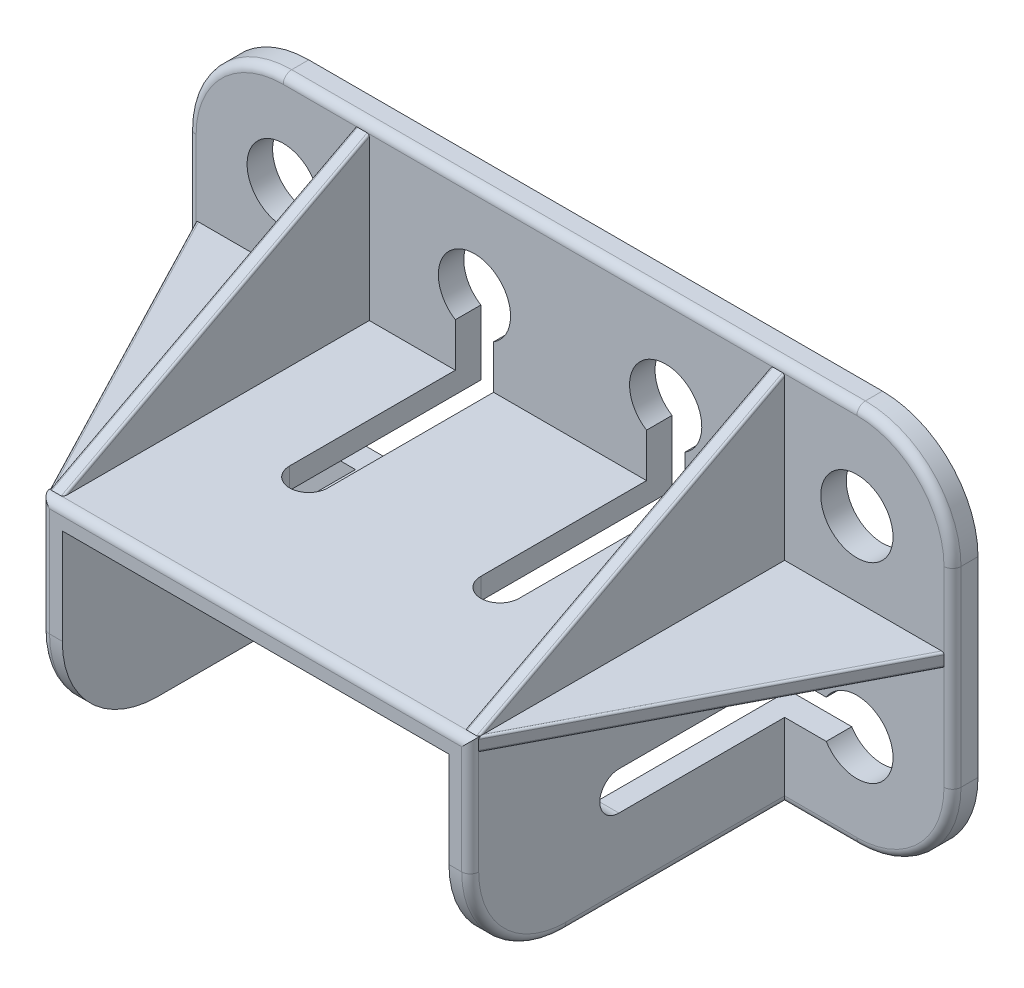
ISO-10303-21;
HEADER;
FILE_DESCRIPTION(('STEP AP214'),'2;1');
FILE_NAME('part.step','',(''),(''),'','','');
FILE_SCHEMA(('AUTOMOTIVE_DESIGN { 1 0 10303 214 1 1 1 1 }'));
ENDSEC;
DATA;
#1=APPLICATION_CONTEXT('core data for automotive mechanical design processes');
#2=APPLICATION_PROTOCOL_DEFINITION('international standard','automotive_design',2000,#1);
#3=PRODUCT_CONTEXT('',#1,'mechanical');
#4=PRODUCT('Part','Part','',(#3));
#5=PRODUCT_RELATED_PRODUCT_CATEGORY('part','',(#4));
#6=PRODUCT_DEFINITION_FORMATION('','',#4);
#7=PRODUCT_DEFINITION_CONTEXT('part definition',#1,'design');
#8=PRODUCT_DEFINITION('design','',#6,#7);
#9=PRODUCT_DEFINITION_SHAPE('','',#8);
#10=(LENGTH_UNIT() NAMED_UNIT(*) SI_UNIT(.MILLI.,.METRE.));
#11=(NAMED_UNIT(*) PLANE_ANGLE_UNIT() SI_UNIT($,.RADIAN.));
#12=(NAMED_UNIT(*) SI_UNIT($,.STERADIAN.) SOLID_ANGLE_UNIT());
#13=UNCERTAINTY_MEASURE_WITH_UNIT(LENGTH_MEASURE(1.E-05),#10,'distance_accuracy_value','');
#14=(GEOMETRIC_REPRESENTATION_CONTEXT(3) GLOBAL_UNCERTAINTY_ASSIGNED_CONTEXT((#13)) GLOBAL_UNIT_ASSIGNED_CONTEXT((#10,
#11,#12)) REPRESENTATION_CONTEXT('',''));
#15=CARTESIAN_POINT('',(0.,0.,0.));
#16=DIRECTION('',(0.,0.,1.));
#17=DIRECTION('',(1.,0.,0.));
#18=AXIS2_PLACEMENT_3D('',#15,#16,#17);
#19=CARTESIAN_POINT('',(-60.1264813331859,2.24999999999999,58.4347511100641));
#20=DIRECTION('',(-0.46193441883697,0.,-0.886914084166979));
#21=DIRECTION('',(-0.886914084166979,0.,0.46193441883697));
#22=AXIS2_PLACEMENT_3D('',#19,#20,#21);
#23=CYLINDRICAL_SURFACE('',#22,0.5);
#24=CARTESIAN_POINT('',(-50.5,2.24999999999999,76.9175952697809));
#25=DIRECTION('',(-1.,0.,0.));
#26=DIRECTION('',(0.,0.,-1.));
#27=AXIS2_PLACEMENT_3D('',#24,#25,#26);
#28=ELLIPSE('',#27,1.08240473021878,0.5);
#29=CARTESIAN_POINT('',(-50.5,1.74999999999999,76.9175952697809));
#30=VERTEX_POINT('',#29);
#31=CARTESIAN_POINT('',(-50.5,2.24999999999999,77.9999999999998));
#32=VERTEX_POINT('',#31);
#33=EDGE_CURVE('E350',#30,#32,#28,.T.);
#34=ORIENTED_EDGE('',*,*,#33,.T.);
#35=DIRECTION('',(0.461934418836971,0.,0.886914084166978));
#36=VECTOR('',#35,1.);
#37=CARTESIAN_POINT('',(-69.2499999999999,2.24999999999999,42.));
#38=LINE('',#37,#36);
#39=CARTESIAN_POINT('',(-88.,2.24999999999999,6.));
#40=VERTEX_POINT('',#39);
#41=EDGE_CURVE('E348',#40,#32,#38,.T.);
#42=ORIENTED_EDGE('',*,*,#41,.F.);
#43=CARTESIAN_POINT('',(-87.4362475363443,2.25,6.));
#44=DIRECTION('',(0.,0.,1.));
#45=DIRECTION('',(-1.,0.,0.));
#46=AXIS2_PLACEMENT_3D('',#43,#44,#45);
#47=ELLIPSE('',#46,0.563752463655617,0.5);
#48=CARTESIAN_POINT('',(-87.4362475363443,1.75,6.));
#49=VERTEX_POINT('',#48);
#50=EDGE_CURVE('E19',#40,#49,#47,.T.);
#51=ORIENTED_EDGE('',*,*,#50,.T.);
#52=DIRECTION('',(-0.46193441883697,0.,-0.886914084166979));
#53=VECTOR('',#52,1.);
#54=CARTESIAN_POINT('',(-60.1264813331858,1.74999999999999,58.434751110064));
#55=LINE('',#54,#53);
#56=EDGE_CURVE('E345',#49,#30,#55,.F.);
#57=ORIENTED_EDGE('',*,*,#56,.T.);
#58=EDGE_LOOP('',(#34,#42,#51,#57));
#59=FACE_BOUND('',#58,.T.);
#60=ADVANCED_FACE('F15',(#59),#23,.T.);
#61=CARTESIAN_POINT('',(50.4999999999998,16.8531324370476,34.8531324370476));
#62=DIRECTION('',(1.,0.,0.));
#63=DIRECTION('',(0.,0.,-1.));
#64=AXIS2_PLACEMENT_3D('',#61,#62,#63);
#65=PLANE('',#64);
#66=DIRECTION('',(0.,-1.,0.));
#67=VECTOR('',#66,1.);
#68=CARTESIAN_POINT('',(50.4999999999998,-2.56377551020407,78.));
#69=LINE('',#68,#67);
#70=CARTESIAN_POINT('',(50.4999999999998,4.49999999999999,78.));
#71=VERTEX_POINT('',#70);
#72=CARTESIAN_POINT('',(50.4999999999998,4.99999999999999,78.));
#73=VERTEX_POINT('',#72);
#74=EDGE_CURVE('E656',#71,#73,#69,.F.);
#75=ORIENTED_EDGE('',*,*,#74,.F.);
#76=CARTESIAN_POINT('',(50.4999999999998,4.49999999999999,76.9175952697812));
#77=DIRECTION('',(1.,0.,0.));
#78=DIRECTION('',(0.,0.,-1.));
#79=AXIS2_PLACEMENT_3D('',#76,#77,#78);
#80=ELLIPSE('',#79,1.08240473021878,0.5);
#81=CARTESIAN_POINT('',(50.4999999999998,4.92923886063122,77.4727074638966));
#82=VERTEX_POINT('',#81);
#83=EDGE_CURVE('E1059',#82,#71,#80,.T.);
#84=ORIENTED_EDGE('',*,*,#83,.F.);
#85=CARTESIAN_POINT('',(50.4999999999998,2.99999999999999,78.));
#86=DIRECTION('',(1.,0.,0.));
#87=DIRECTION('',(0.,1.,0.));
#88=AXIS2_PLACEMENT_3D('',#85,#86,#87);
#89=CIRCLE('',#88,2.);
#90=EDGE_CURVE('E1119',#73,#82,#89,.F.);
#91=ORIENTED_EDGE('',*,*,#90,.F.);
#92=EDGE_LOOP('',(#75,#84,#91));
#93=FACE_BOUND('',#92,.T.);
#94=ADVANCED_FACE('F1646',(#93),#65,.T.);
#95=CARTESIAN_POINT('',(60.1264813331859,2.24999999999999,58.4347511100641));
#96=DIRECTION('',(0.46193441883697,0.,-0.886914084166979));
#97=DIRECTION('',(-0.886914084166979,0.,-0.46193441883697));
#98=AXIS2_PLACEMENT_3D('',#95,#96,#97);
#99=CYLINDRICAL_SURFACE('',#98,0.5);
#100=CARTESIAN_POINT('',(50.4999999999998,2.24999999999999,76.9175952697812));
#101=DIRECTION('',(1.,0.,0.));
#102=DIRECTION('',(0.,0.,-1.));
#103=AXIS2_PLACEMENT_3D('',#100,#101,#102);
#104=ELLIPSE('',#103,1.08240473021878,0.5);
#105=CARTESIAN_POINT('',(50.4999999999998,2.24999999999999,78.));
#106=VERTEX_POINT('',#105);
#107=CARTESIAN_POINT('',(50.4999999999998,1.74999999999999,76.9175952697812));
#108=VERTEX_POINT('',#107);
#109=EDGE_CURVE('E1360',#106,#108,#104,.T.);
#110=ORIENTED_EDGE('',*,*,#109,.T.);
#111=DIRECTION('',(0.46193441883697,0.,-0.886914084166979));
#112=VECTOR('',#111,1.);
#113=CARTESIAN_POINT('',(50.4999999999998,1.74999999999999,76.9175952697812));
#114=LINE('',#113,#112);
#115=CARTESIAN_POINT('',(87.4362475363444,1.75,6.));
#116=VERTEX_POINT('',#115);
#117=EDGE_CURVE('E1023',#108,#116,#114,.T.);
#118=ORIENTED_EDGE('',*,*,#117,.T.);
#119=CARTESIAN_POINT('',(87.4362475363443,2.25,6.));
#120=DIRECTION('',(0.,0.,1.));
#121=DIRECTION('',(1.,0.,0.));
#122=AXIS2_PLACEMENT_3D('',#119,#120,#121);
#123=ELLIPSE('',#122,0.563752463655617,0.5);
#124=CARTESIAN_POINT('',(88.,2.24999999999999,6.));
#125=VERTEX_POINT('',#124);
#126=EDGE_CURVE('E1165',#116,#125,#123,.T.);
#127=ORIENTED_EDGE('',*,*,#126,.T.);
#128=DIRECTION('',(0.46193441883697,0.,-0.886914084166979));
#129=VECTOR('',#128,1.);
#130=CARTESIAN_POINT('',(50.4999999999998,2.24999999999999,78.));
#131=LINE('',#130,#129);
#132=EDGE_CURVE('E452',#106,#125,#131,.T.);
#133=ORIENTED_EDGE('',*,*,#132,.F.);
#134=EDGE_LOOP('',(#110,#118,#127,#133));
#135=FACE_BOUND('',#134,.T.);
#136=ADVANCED_FACE('F1641',(#135),#99,.T.);
#137=CARTESIAN_POINT('',(-47.7499999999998,33.7543792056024,22.446800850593));
#138=DIRECTION('',(0.,-0.466758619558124,0.884384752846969));
#139=DIRECTION('',(0.,-0.884384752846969,-0.466758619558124));
#140=AXIS2_PLACEMENT_3D('',#137,#138,#139);
#141=CYLINDRICAL_SURFACE('',#140,0.5);
#142=CARTESIAN_POINT('',(-47.7499999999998,42.4346352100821,6.));
#143=DIRECTION('',(0.,0.,1.));
#144=DIRECTION('',(0.,-1.,0.));
#145=AXIS2_PLACEMENT_3D('',#142,#143,#144);
#146=ELLIPSE('',#145,0.56536478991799,0.5);
#147=CARTESIAN_POINT('',(-47.2499999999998,42.4346352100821,6.));
#148=VERTEX_POINT('',#147);
#149=CARTESIAN_POINT('',(-47.7499999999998,43.,6.));
#150=VERTEX_POINT('',#149);
#151=EDGE_CURVE('E1366',#148,#150,#146,.T.);
#152=ORIENTED_EDGE('',*,*,#151,.T.);
#153=DIRECTION('',(0.,0.466758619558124,-0.884384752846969));
#154=VECTOR('',#153,1.);
#155=CARTESIAN_POINT('',(-47.7499999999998,24.,42.));
#156=LINE('',#155,#154);
#157=CARTESIAN_POINT('',(-47.7499999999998,4.99999999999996,78.));
#158=VERTEX_POINT('',#157);
#159=EDGE_CURVE('E449',#158,#150,#156,.T.);
#160=ORIENTED_EDGE('',*,*,#159,.F.);
#161=CARTESIAN_POINT('',(-47.7499999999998,4.99999999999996,76.9287825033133));
#162=DIRECTION('',(0.,1.,0.));
#163=DIRECTION('',(0.,0.,1.));
#164=AXIS2_PLACEMENT_3D('',#161,#162,#163);
#165=ELLIPSE('',#164,1.07121749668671,0.5);
#166=CARTESIAN_POINT('',(-47.2499999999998,4.99999999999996,76.9287825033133));
#167=VERTEX_POINT('',#166);
#168=EDGE_CURVE('E1364',#158,#167,#165,.T.);
#169=ORIENTED_EDGE('',*,*,#168,.T.);
#170=DIRECTION('',(0.,-0.466758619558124,0.884384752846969));
#171=VECTOR('',#170,1.);
#172=CARTESIAN_POINT('',(-47.2499999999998,33.7543792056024,22.446800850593));
#173=LINE('',#172,#171);
#174=EDGE_CURVE('E358',#167,#148,#173,.F.);
#175=ORIENTED_EDGE('',*,*,#174,.T.);
#176=EDGE_LOOP('',(#152,#160,#169,#175));
#177=FACE_BOUND('',#176,.T.);
#178=ADVANCED_FACE('F1633',(#177),#141,.T.);
#179=CARTESIAN_POINT('',(47.7499999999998,33.7543792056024,22.446800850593));
#180=DIRECTION('',(0.,-0.466758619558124,0.884384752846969));
#181=DIRECTION('',(0.,-0.884384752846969,-0.466758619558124));
#182=AXIS2_PLACEMENT_3D('',#179,#180,#181);
#183=CYLINDRICAL_SURFACE('',#182,0.5);
#184=CARTESIAN_POINT('',(47.7499999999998,42.4346352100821,6.));
#185=DIRECTION('',(0.,0.,1.));
#186=DIRECTION('',(0.,-1.,0.));
#187=AXIS2_PLACEMENT_3D('',#184,#185,#186);
#188=ELLIPSE('',#187,0.56536478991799,0.5);
#189=CARTESIAN_POINT('',(47.7499999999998,43.,6.));
#190=VERTEX_POINT('',#189);
#191=CARTESIAN_POINT('',(47.2499999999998,42.4346352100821,6.));
#192=VERTEX_POINT('',#191);
#193=EDGE_CURVE('E1370',#190,#192,#188,.T.);
#194=ORIENTED_EDGE('',*,*,#193,.T.);
#195=DIRECTION('',(0.,-0.466758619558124,0.884384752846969));
#196=VECTOR('',#195,1.);
#197=CARTESIAN_POINT('',(47.2499999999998,42.4346352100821,6.));
#198=LINE('',#197,#196);
#199=CARTESIAN_POINT('',(47.2499999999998,4.99999999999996,76.9287825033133));
#200=VERTEX_POINT('',#199);
#201=EDGE_CURVE('E651',#192,#200,#198,.T.);
#202=ORIENTED_EDGE('',*,*,#201,.T.);
#203=CARTESIAN_POINT('',(47.7499999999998,4.99999999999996,76.9287825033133));
#204=DIRECTION('',(0.,1.,0.));
#205=DIRECTION('',(0.,0.,1.));
#206=AXIS2_PLACEMENT_3D('',#203,#204,#205);
#207=ELLIPSE('',#206,1.07121749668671,0.5);
#208=CARTESIAN_POINT('',(47.7499999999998,4.99999999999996,78.));
#209=VERTEX_POINT('',#208);
#210=EDGE_CURVE('E1368',#200,#209,#207,.T.);
#211=ORIENTED_EDGE('',*,*,#210,.T.);
#212=DIRECTION('',(0.,-0.466758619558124,0.884384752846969));
#213=VECTOR('',#212,1.);
#214=CARTESIAN_POINT('',(47.7499999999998,43.0000000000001,6.));
#215=LINE('',#214,#213);
#216=EDGE_CURVE('E446',#190,#209,#215,.T.);
#217=ORIENTED_EDGE('',*,*,#216,.F.);
#218=EDGE_LOOP('',(#194,#202,#211,#217));
#219=FACE_BOUND('',#218,.T.);
#220=ADVANCED_FACE('F1635',(#219),#183,.T.);
#221=CARTESIAN_POINT('',(49.9999999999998,33.7543792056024,22.446800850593));
#222=DIRECTION('',(0.,-0.466758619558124,0.884384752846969));
#223=DIRECTION('',(0.,-0.884384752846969,-0.466758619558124));
#224=AXIS2_PLACEMENT_3D('',#221,#222,#223);
#225=CYLINDRICAL_SURFACE('',#224,0.5);
#226=DIRECTION('',(0.,-0.466758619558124,0.884384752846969));
#227=VECTOR('',#226,1.);
#228=CARTESIAN_POINT('',(49.9999999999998,43.0000000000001,6.));
#229=LINE('',#228,#227);
#230=CARTESIAN_POINT('',(49.9999999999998,4.99999999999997,78.));
#231=VERTEX_POINT('',#230);
#232=CARTESIAN_POINT('',(49.9999999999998,43.,6.));
#233=VERTEX_POINT('',#232);
#234=EDGE_CURVE('E445',#231,#233,#229,.F.);
#235=ORIENTED_EDGE('',*,*,#234,.F.);
#236=CARTESIAN_POINT('',(50.4449637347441,4.94290755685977,77.5255421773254));
#237=CARTESIAN_POINT('',(50.4360078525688,4.94915089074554,77.5510908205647));
#238=CARTESIAN_POINT('',(50.4260957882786,4.95480529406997,77.5764499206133));
#239=CARTESIAN_POINT('',(50.4043398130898,4.96500630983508,77.6266329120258));
#240=CARTESIAN_POINT('',(50.392491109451,4.96955010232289,77.65145529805));
#241=CARTESIAN_POINT('',(50.3668393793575,4.97758421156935,77.7003697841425));
#242=CARTESIAN_POINT('',(50.3530291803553,4.98107050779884,77.7244587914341));
#243=CARTESIAN_POINT('',(50.3233920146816,4.98704051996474,77.77146296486));
#244=CARTESIAN_POINT('',(50.3075677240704,4.98952554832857,77.7943796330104));
#245=CARTESIAN_POINT('',(50.2769605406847,4.99320017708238,77.8342521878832));
#246=CARTESIAN_POINT('',(50.2625770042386,4.99454793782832,77.8514986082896));
#247=CARTESIAN_POINT('',(50.2320897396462,4.99673309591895,77.8845398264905));
#248=CARTESIAN_POINT('',(50.2159818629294,4.99756922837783,77.9003309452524));
#249=CARTESIAN_POINT('',(50.1815475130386,4.99882799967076,77.9299362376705));
#250=CARTESIAN_POINT('',(50.1631904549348,4.99924401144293,77.9437158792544));
#251=CARTESIAN_POINT('',(50.1243608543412,4.99977407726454,77.9676594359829));
#252=CARTESIAN_POINT('',(50.1039090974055,4.99989084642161,77.9778551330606));
#253=CARTESIAN_POINT('',(50.0693759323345,4.99998116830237,77.9900543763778));
#254=CARTESIAN_POINT('',(50.0558835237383,4.99999260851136,77.9937009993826));
#255=CARTESIAN_POINT('',(50.0282836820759,5.00000018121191,77.9987107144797));
#256=CARTESIAN_POINT('',(50.0141701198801,4.99999608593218,78.0000394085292));
#257=CARTESIAN_POINT('',(49.9999999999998,4.99999999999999,77.9999999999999));
#258=B_SPLINE_CURVE_WITH_KNOTS('',3,(#236,#237,#238,#239,#240,#241,#242,#243,#244,#245,#246,
#247,#248,#249,#250,#251,#252,#253,#254,#255,#256,#257),.UNSPECIFIED.,.F.,.F.,(4,2,2,2,2,2,2,2,
2,2,4),(0.,0.0833296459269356,0.166868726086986,0.250721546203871,0.334464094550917,
0.40186525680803,0.469432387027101,0.53804942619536,0.606041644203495,0.647783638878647,
0.690139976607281),.UNSPECIFIED.);
#259=CARTESIAN_POINT('',(50.4449637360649,4.94290756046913,77.525542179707));
#260=VERTEX_POINT('',#259);
#261=EDGE_CURVE('E596',#260,#231,#258,.T.);
#262=ORIENTED_EDGE('',*,*,#261,.F.);
#263=CARTESIAN_POINT('',(50.4999999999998,4.99997304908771,76.9288335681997));
#264=CARTESIAN_POINT('',(50.4999944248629,4.99984675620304,76.95401870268));
#265=CARTESIAN_POINT('',(50.4995935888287,4.99932979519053,76.979194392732));
#266=CARTESIAN_POINT('',(50.4981028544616,4.99761561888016,77.0294938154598));
#267=CARTESIAN_POINT('',(50.4970132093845,4.99641865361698,77.0546175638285));
#268=CARTESIAN_POINT('',(50.4928709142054,4.99196752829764,77.1297390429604));
#269=CARTESIAN_POINT('',(50.4889436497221,4.98785116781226,77.1796378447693));
#270=CARTESIAN_POINT('',(50.4792484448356,4.97781113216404,77.2790425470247));
#271=CARTESIAN_POINT('',(50.4734810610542,4.97188800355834,77.328548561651));
#272=CARTESIAN_POINT('',(50.4603525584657,4.95849192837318,77.4272934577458));
#273=CARTESIAN_POINT('',(50.4529867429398,4.95101441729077,77.4765311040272));
#274=CARTESIAN_POINT('',(50.4449637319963,4.94290756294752,77.5255421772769));
#275=B_SPLINE_CURVE_WITH_KNOTS('',3,(#263,#264,#265,#266,#267,#268,#269,#270,#271,#272,#273,
#274),.UNSPECIFIED.,.F.,.F.,(4,2,2,2,2,4),(0.,0.0755388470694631,0.151049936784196,
0.301620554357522,0.452145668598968,0.603119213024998),.UNSPECIFIED.);
#276=CARTESIAN_POINT('',(50.4999999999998,4.99997304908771,76.9288335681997));
#277=VERTEX_POINT('',#276);
#278=EDGE_CURVE('E1061',#277,#260,#275,.T.);
#279=ORIENTED_EDGE('',*,*,#278,.F.);
#280=DIRECTION('',(0.,-0.466758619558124,0.884384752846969));
#281=VECTOR('',#280,1.);
#282=CARTESIAN_POINT('',(50.4999999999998,42.4346352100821,6.));
#283=LINE('',#282,#281);
#284=CARTESIAN_POINT('',(50.4999999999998,42.4346352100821,6.));
#285=VERTEX_POINT('',#284);
#286=EDGE_CURVE('E591',#285,#277,#283,.T.);
#287=ORIENTED_EDGE('',*,*,#286,.F.);
#288=CARTESIAN_POINT('',(49.9999999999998,42.4346352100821,6.));
#289=DIRECTION('',(0.,0.,1.));
#290=DIRECTION('',(0.,-1.,0.));
#291=AXIS2_PLACEMENT_3D('',#288,#289,#290);
#292=ELLIPSE('',#291,0.56536478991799,0.5);
#293=EDGE_CURVE('E1131',#285,#233,#292,.T.);
#294=ORIENTED_EDGE('',*,*,#293,.T.);
#295=EDGE_LOOP('',(#235,#262,#279,#287,#294));
#296=FACE_BOUND('',#295,.T.);
#297=ADVANCED_FACE('F609',(#296),#225,.T.);
#298=CARTESIAN_POINT('',(54.0297420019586,4.49999999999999,70.1404906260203));
#299=DIRECTION('',(0.46193441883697,0.,-0.886914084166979));
#300=DIRECTION('',(-0.886914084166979,0.,-0.46193441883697));
#301=AXIS2_PLACEMENT_3D('',#298,#299,#300);
#302=CYLINDRICAL_SURFACE('',#301,0.5);
#303=ORIENTED_EDGE('',*,*,#83,.T.);
#304=DIRECTION('',(0.46193441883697,0.,-0.886914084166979));
#305=VECTOR('',#304,1.);
#306=CARTESIAN_POINT('',(50.4999999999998,4.5,78.));
#307=LINE('',#306,#305);
#308=CARTESIAN_POINT('',(88.,4.5,6.));
#309=VERTEX_POINT('',#308);
#310=EDGE_CURVE('E453',#309,#71,#307,.F.);
#311=ORIENTED_EDGE('',*,*,#310,.F.);
#312=CARTESIAN_POINT('',(87.4362475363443,4.5,6.00000000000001));
#313=DIRECTION('',(0.,0.,1.));
#314=DIRECTION('',(1.,0.,0.));
#315=AXIS2_PLACEMENT_3D('',#312,#313,#314);
#316=ELLIPSE('',#315,0.563752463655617,0.5);
#317=CARTESIAN_POINT('',(87.4362475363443,4.99999999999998,6.00000000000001));
#318=VERTEX_POINT('',#317);
#319=EDGE_CURVE('E1066',#309,#318,#316,.T.);
#320=ORIENTED_EDGE('',*,*,#319,.T.);
#321=DIRECTION('',(0.46193441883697,0.,-0.886914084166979));
#322=VECTOR('',#321,1.);
#323=CARTESIAN_POINT('',(50.4999999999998,4.99999999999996,76.9175952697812));
#324=LINE('',#323,#322);
#325=CARTESIAN_POINT('',(50.4999999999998,4.99999999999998,76.9175952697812));
#326=VERTEX_POINT('',#325);
#327=EDGE_CURVE('E590',#326,#318,#324,.T.);
#328=ORIENTED_EDGE('',*,*,#327,.F.);
#329=CARTESIAN_POINT('',(50.4999999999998,4.49999999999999,76.9175952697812));
#330=DIRECTION('',(1.,0.,0.));
#331=DIRECTION('',(0.,0.,-1.));
#332=AXIS2_PLACEMENT_3D('',#329,#330,#331);
#333=ELLIPSE('',#332,1.08240473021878,0.5);
#334=EDGE_CURVE('E588',#277,#326,#333,.F.);
#335=ORIENTED_EDGE('',*,*,#334,.F.);
#336=ORIENTED_EDGE('',*,*,#278,.T.);
#337=CARTESIAN_POINT('',(50.4999999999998,4.92923886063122,77.4727074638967));
#338=CARTESIAN_POINT('',(50.4908646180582,4.931646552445,77.4815186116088));
#339=CARTESIAN_POINT('',(50.4817105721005,4.93398945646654,77.4903270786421));
#340=CARTESIAN_POINT('',(50.4633651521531,4.93854568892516,77.5079386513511));
#341=CARTESIAN_POINT('',(50.4541737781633,4.94075901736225,77.5167417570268));
#342=CARTESIAN_POINT('',(50.4449637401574,4.94290755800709,77.5255421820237));
#343=B_SPLINE_CURVE_WITH_KNOTS('',3,(#337,#338,#339,#340,#341,#342),.UNSPECIFIED.,.F.,.F.,(4,2,
4),(0.,0.0387540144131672,0.0775080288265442),.UNSPECIFIED.);
#344=EDGE_CURVE('E603',#82,#260,#343,.T.);
#345=ORIENTED_EDGE('',*,*,#344,.F.);
#346=EDGE_LOOP('',(#303,#311,#320,#328,#335,#336,#345));
#347=FACE_BOUND('',#346,.T.);
#348=ADVANCED_FACE('F1068',(#347),#302,.T.);
#349=CARTESIAN_POINT('',(-49.9999999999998,33.7543792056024,22.446800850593));
#350=DIRECTION('',(0.,-0.466758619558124,0.884384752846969));
#351=DIRECTION('',(0.,-0.884384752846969,-0.466758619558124));
#352=AXIS2_PLACEMENT_3D('',#349,#350,#351);
#353=CYLINDRICAL_SURFACE('',#352,0.5);
#354=CARTESIAN_POINT('',(-49.9999999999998,42.4346352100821,6.));
#355=DIRECTION('',(0.,0.,1.));
#356=DIRECTION('',(0.,-1.,0.));
#357=AXIS2_PLACEMENT_3D('',#354,#355,#356);
#358=ELLIPSE('',#357,0.56536478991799,0.5);
#359=CARTESIAN_POINT('',(-49.9999999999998,43.,6.));
#360=VERTEX_POINT('',#359);
#361=CARTESIAN_POINT('',(-50.4999999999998,42.4346352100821,6.00000000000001));
#362=VERTEX_POINT('',#361);
#363=EDGE_CURVE('E1057',#360,#362,#358,.T.);
#364=ORIENTED_EDGE('',*,*,#363,.T.);
#365=DIRECTION('',(0.,0.466758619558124,-0.884384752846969));
#366=VECTOR('',#365,1.);
#367=CARTESIAN_POINT('',(-50.4999999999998,4.99999999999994,76.9287825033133));
#368=LINE('',#367,#366);
#369=CARTESIAN_POINT('',(-50.4999999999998,4.99999999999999,76.9287825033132));
#370=VERTEX_POINT('',#369);
#371=EDGE_CURVE('E584',#370,#362,#368,.T.);
#372=ORIENTED_EDGE('',*,*,#371,.F.);
#373=CARTESIAN_POINT('',(-49.9999999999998,4.99999999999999,76.9287825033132));
#374=DIRECTION('',(0.,1.,0.));
#375=DIRECTION('',(0.,0.,1.));
#376=AXIS2_PLACEMENT_3D('',#373,#374,#375);
#377=ELLIPSE('',#376,1.07121749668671,0.5);
#378=CARTESIAN_POINT('',(-49.9999999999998,4.99999999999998,78.));
#379=VERTEX_POINT('',#378);
#380=EDGE_CURVE('E1055',#379,#370,#377,.F.);
#381=ORIENTED_EDGE('',*,*,#380,.F.);
#382=DIRECTION('',(0.,-0.466758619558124,0.884384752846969));
#383=VECTOR('',#382,1.);
#384=CARTESIAN_POINT('',(-49.9999999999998,24.,42.));
#385=LINE('',#384,#383);
#386=EDGE_CURVE('E450',#360,#379,#385,.T.);
#387=ORIENTED_EDGE('',*,*,#386,.F.);
#388=EDGE_LOOP('',(#364,#372,#381,#387));
#389=FACE_BOUND('',#388,.T.);
#390=ADVANCED_FACE('F1071',(#389),#353,.T.);
#391=CARTESIAN_POINT('',(-50.5,4.99999999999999,76.9287825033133));
#392=DIRECTION('',(0.,1.,0.));
#393=DIRECTION('',(0.,0.,1.));
#394=AXIS2_PLACEMENT_3D('',#391,#392,#393);
#395=PLANE('',#394);
#396=DIRECTION('',(1.,0.,0.));
#397=VECTOR('',#396,1.);
#398=CARTESIAN_POINT('',(-25.25,4.99999999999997,78.));
#399=LINE('',#398,#397);
#400=CARTESIAN_POINT('',(-50.4999999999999,4.99999999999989,78.));
#401=VERTEX_POINT('',#400);
#402=EDGE_CURVE('E595',#379,#401,#399,.F.);
#403=ORIENTED_EDGE('',*,*,#402,.F.);
#404=ORIENTED_EDGE('',*,*,#380,.T.);
#405=DIRECTION('',(0.,0.,-1.));
#406=VECTOR('',#405,1.);
#407=CARTESIAN_POINT('',(-50.4999999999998,4.99999999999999,78.));
#408=LINE('',#407,#406);
#409=EDGE_CURVE('E575',#401,#370,#408,.T.);
#410=ORIENTED_EDGE('',*,*,#409,.F.);
#411=EDGE_LOOP('',(#403,#404,#410));
#412=FACE_BOUND('',#411,.T.);
#413=ADVANCED_FACE('F1075',(#412),#395,.T.);
#414=CARTESIAN_POINT('',(-60.1264813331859,4.49999999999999,58.4347511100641));
#415=DIRECTION('',(-0.46193441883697,0.,-0.886914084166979));
#416=DIRECTION('',(-0.886914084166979,0.,0.46193441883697));
#417=AXIS2_PLACEMENT_3D('',#414,#415,#416);
#418=CYLINDRICAL_SURFACE('',#417,0.5);
#419=CARTESIAN_POINT('',(-50.4999999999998,4.49999999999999,76.9175952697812));
#420=DIRECTION('',(-1.,0.,0.));
#421=DIRECTION('',(0.,0.,-1.));
#422=AXIS2_PLACEMENT_3D('',#419,#420,#421);
#423=ELLIPSE('',#422,1.08240473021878,0.5);
#424=CARTESIAN_POINT('',(-50.4999999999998,4.99999999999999,76.9175952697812));
#425=VERTEX_POINT('',#424);
#426=CARTESIAN_POINT('',(-50.4999999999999,4.49999999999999,78.));
#427=VERTEX_POINT('',#426);
#428=EDGE_CURVE('E581',#425,#427,#423,.F.);
#429=ORIENTED_EDGE('',*,*,#428,.F.);
#430=DIRECTION('',(0.46193441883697,0.,0.886914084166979));
#431=VECTOR('',#430,1.);
#432=CARTESIAN_POINT('',(-87.4362475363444,5.,5.99999999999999));
#433=LINE('',#432,#431);
#434=CARTESIAN_POINT('',(-87.4362475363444,5.,6.));
#435=VERTEX_POINT('',#434);
#436=EDGE_CURVE('E573',#435,#425,#433,.T.);
#437=ORIENTED_EDGE('',*,*,#436,.F.);
#438=CARTESIAN_POINT('',(-87.4362475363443,4.5,6.));
#439=DIRECTION('',(0.,0.,1.));
#440=DIRECTION('',(-1.,0.,0.));
#441=AXIS2_PLACEMENT_3D('',#438,#439,#440);
#442=ELLIPSE('',#441,0.563752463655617,0.5);
#443=CARTESIAN_POINT('',(-88.,4.5,6.));
#444=VERTEX_POINT('',#443);
#445=EDGE_CURVE('E441',#435,#444,#442,.T.);
#446=ORIENTED_EDGE('',*,*,#445,.T.);
#447=DIRECTION('',(-0.46193441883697,0.,-0.886914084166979));
#448=VECTOR('',#447,1.);
#449=CARTESIAN_POINT('',(-69.2499999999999,4.5,42.));
#450=LINE('',#449,#448);
#451=EDGE_CURVE('E438',#427,#444,#450,.T.);
#452=ORIENTED_EDGE('',*,*,#451,.F.);
#453=EDGE_LOOP('',(#429,#437,#446,#452));
#454=FACE_BOUND('',#453,.T.);
#455=ADVANCED_FACE('F646',(#454),#418,.T.);
#456=CARTESIAN_POINT('',(-50.4999999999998,4.5,78.));
#457=DIRECTION('',(-0.886914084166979,0.,0.46193441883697));
#458=DIRECTION('',(-0.46193441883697,0.,-0.886914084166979));
#459=AXIS2_PLACEMENT_3D('',#456,#457,#458);
#460=PLANE('',#459);
#461=ORIENTED_EDGE('',*,*,#41,.T.);
#462=DIRECTION('',(0.,1.,0.));
#463=VECTOR('',#462,1.);
#464=CARTESIAN_POINT('',(-50.5,-27.5637755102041,78.));
#465=LINE('',#464,#463);
#466=EDGE_CURVE('E653',#427,#32,#465,.F.);
#467=ORIENTED_EDGE('',*,*,#466,.F.);
#468=ORIENTED_EDGE('',*,*,#451,.T.);
#469=DIRECTION('',(0.,1.,0.));
#470=VECTOR('',#469,1.);
#471=CARTESIAN_POINT('',(-88.,-10.2575479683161,6.));
#472=LINE('',#471,#470);
#473=EDGE_CURVE('E572',#40,#444,#472,.T.);
#474=ORIENTED_EDGE('',*,*,#473,.F.);
#475=EDGE_LOOP('',(#461,#467,#468,#474));
#476=FACE_BOUND('',#475,.T.);
#477=ADVANCED_FACE('F1101',(#476),#460,.T.);
#478=CARTESIAN_POINT('',(-87.4362475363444,1.75,6.));
#479=DIRECTION('',(0.,1.,0.));
#480=DIRECTION('',(0.,0.,1.));
#481=AXIS2_PLACEMENT_3D('',#478,#479,#480);
#482=PLANE('',#481);
#483=DIRECTION('',(1.,0.,0.));
#484=VECTOR('',#483,1.);
#485=CARTESIAN_POINT('',(0.,1.74999999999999,6.));
#486=LINE('',#485,#484);
#487=CARTESIAN_POINT('',(-50.5,1.74999999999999,6.));
#488=VERTEX_POINT('',#487);
#489=EDGE_CURVE('E354',#488,#49,#486,.F.);
#490=ORIENTED_EDGE('',*,*,#489,.F.);
#491=DIRECTION('',(0.,0.,1.));
#492=VECTOR('',#491,1.);
#493=CARTESIAN_POINT('',(-50.5,1.74999999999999,6.));
#494=LINE('',#493,#492);
#495=EDGE_CURVE('E357',#30,#488,#494,.F.);
#496=ORIENTED_EDGE('',*,*,#495,.F.);
#497=ORIENTED_EDGE('',*,*,#56,.F.);
#498=EDGE_LOOP('',(#490,#496,#497));
#499=FACE_BOUND('',#498,.T.);
#500=ADVANCED_FACE('F353',(#499),#482,.F.);
#501=CARTESIAN_POINT('',(-48.4999999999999,-22.5,57.5));
#502=DIRECTION('',(1.,0.,0.));
#503=DIRECTION('',(0.,0.,-1.));
#504=AXIS2_PLACEMENT_3D('',#501,#502,#503);
#505=TOROIDAL_SURFACE('',#504,20.5,2.);
#506=CARTESIAN_POINT('',(-48.5,-22.5,78.));
#507=DIRECTION('',(0.,1.,0.));
#508=DIRECTION('',(-1.,0.,0.));
#509=AXIS2_PLACEMENT_3D('',#506,#507,#508);
#510=CIRCLE('',#509,2.);
#511=CARTESIAN_POINT('',(-50.5,-22.5,78.));
#512=VERTEX_POINT('',#511);
#513=CARTESIAN_POINT('',(-48.5,-22.5,80.));
#514=VERTEX_POINT('',#513);
#515=EDGE_CURVE('E657',#512,#514,#510,.T.);
#516=ORIENTED_EDGE('',*,*,#515,.F.);
#517=CARTESIAN_POINT('',(-50.5,-22.5,57.5));
#518=DIRECTION('',(1.,0.,0.));
#519=DIRECTION('',(0.,0.,1.));
#520=AXIS2_PLACEMENT_3D('',#517,#518,#519);
#521=CIRCLE('',#520,20.5);
#522=CARTESIAN_POINT('',(-50.5,-43.,57.5));
#523=VERTEX_POINT('',#522);
#524=EDGE_CURVE('E662',#523,#512,#521,.F.);
#525=ORIENTED_EDGE('',*,*,#524,.F.);
#526=CARTESIAN_POINT('',(-48.5,-43.,57.5));
#527=DIRECTION('',(0.,0.,1.));
#528=DIRECTION('',(1.,0.,0.));
#529=AXIS2_PLACEMENT_3D('',#526,#527,#528);
#530=CIRCLE('',#529,2.);
#531=CARTESIAN_POINT('',(-48.4999999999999,-45.,57.5));
#532=VERTEX_POINT('',#531);
#533=EDGE_CURVE('E403',#532,#523,#530,.F.);
#534=ORIENTED_EDGE('',*,*,#533,.F.);
#535=CARTESIAN_POINT('',(-48.5,-22.5,57.5));
#536=DIRECTION('',(-1.,0.,0.));
#537=DIRECTION('',(0.,-1.,0.));
#538=AXIS2_PLACEMENT_3D('',#535,#536,#537);
#539=CIRCLE('',#538,22.5);
#540=EDGE_CURVE('E385',#514,#532,#539,.F.);
#541=ORIENTED_EDGE('',*,*,#540,.F.);
#542=EDGE_LOOP('',(#516,#525,#534,#541));
#543=FACE_BOUND('',#542,.T.);
#544=ADVANCED_FACE('F640',(#543),#505,.T.);
#545=CARTESIAN_POINT('',(-47.2499999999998,42.4346352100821,76.9287825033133));
#546=DIRECTION('',(-1.,0.,0.));
#547=DIRECTION('',(0.,0.,-1.));
#548=AXIS2_PLACEMENT_3D('',#545,#546,#547);
#549=PLANE('',#548);
#550=DIRECTION('',(0.,0.,1.));
#551=VECTOR('',#550,1.);
#552=CARTESIAN_POINT('',(-47.2499999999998,4.99999999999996,6.));
#553=LINE('',#552,#551);
#554=CARTESIAN_POINT('',(-47.2499999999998,4.99999999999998,6.));
#555=VERTEX_POINT('',#554);
#556=EDGE_CURVE('E1482',#555,#167,#553,.T.);
#557=ORIENTED_EDGE('',*,*,#556,.F.);
#558=DIRECTION('',(0.,1.,0.));
#559=VECTOR('',#558,1.);
#560=CARTESIAN_POINT('',(-47.2499999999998,1.98490406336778,6.));
#561=LINE('',#560,#559);
#562=EDGE_CURVE('E568',#148,#555,#561,.F.);
#563=ORIENTED_EDGE('',*,*,#562,.F.);
#564=ORIENTED_EDGE('',*,*,#174,.F.);
#565=EDGE_LOOP('',(#557,#563,#564));
#566=FACE_BOUND('',#565,.T.);
#567=ADVANCED_FACE('F638',(#566),#549,.F.);
#568=CARTESIAN_POINT('',(47.2499999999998,16.8531324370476,34.8531324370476));
#569=DIRECTION('',(1.,0.,0.));
#570=DIRECTION('',(0.,0.,-1.));
#571=AXIS2_PLACEMENT_3D('',#568,#569,#570);
#572=PLANE('',#571);
#573=DIRECTION('',(0.,1.,0.));
#574=VECTOR('',#573,1.);
#575=CARTESIAN_POINT('',(47.2499999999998,1.98490406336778,6.));
#576=LINE('',#575,#574);
#577=CARTESIAN_POINT('',(47.2499999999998,4.99999999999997,6.));
#578=VERTEX_POINT('',#577);
#579=EDGE_CURVE('E1485',#578,#192,#576,.T.);
#580=ORIENTED_EDGE('',*,*,#579,.F.);
#581=DIRECTION('',(0.,0.,1.));
#582=VECTOR('',#581,1.);
#583=CARTESIAN_POINT('',(47.2499999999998,4.99999999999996,6.));
#584=LINE('',#583,#582);
#585=EDGE_CURVE('E1475',#200,#578,#584,.F.);
#586=ORIENTED_EDGE('',*,*,#585,.F.);
#587=ORIENTED_EDGE('',*,*,#201,.F.);
#588=EDGE_LOOP('',(#580,#586,#587));
#589=FACE_BOUND('',#588,.T.);
#590=ADVANCED_FACE('F634',(#589),#572,.F.);
#591=CARTESIAN_POINT('',(62.1700886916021,1.74999999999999,34.9200886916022));
#592=DIRECTION('',(0.,1.,0.));
#593=DIRECTION('',(0.,0.,1.));
#594=AXIS2_PLACEMENT_3D('',#591,#592,#593);
#595=PLANE('',#594);
#596=DIRECTION('',(0.,0.,-1.));
#597=VECTOR('',#596,1.);
#598=CARTESIAN_POINT('',(50.4999999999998,1.74999999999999,6.));
#599=LINE('',#598,#597);
#600=CARTESIAN_POINT('',(50.4999999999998,1.74999999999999,6.));
#601=VERTEX_POINT('',#600);
#602=EDGE_CURVE('E1459',#601,#108,#599,.F.);
#603=ORIENTED_EDGE('',*,*,#602,.F.);
#604=DIRECTION('',(1.,0.,0.));
#605=VECTOR('',#604,1.);
#606=CARTESIAN_POINT('',(0.,1.75,6.));
#607=LINE('',#606,#605);
#608=EDGE_CURVE('E562',#116,#601,#607,.F.);
#609=ORIENTED_EDGE('',*,*,#608,.F.);
#610=ORIENTED_EDGE('',*,*,#117,.F.);
#611=EDGE_LOOP('',(#603,#609,#610));
#612=FACE_BOUND('',#611,.T.);
#613=ADVANCED_FACE('F630',(#612),#595,.F.);
#614=CARTESIAN_POINT('',(-48.5,-27.5637755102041,78.));
#615=DIRECTION('',(0.,1.,0.));
#616=DIRECTION('',(-1.,0.,0.));
#617=AXIS2_PLACEMENT_3D('',#614,#615,#616);
#618=CYLINDRICAL_SURFACE('',#617,2.);
#619=ORIENTED_EDGE('',*,*,#466,.T.);
#620=DIRECTION('',(0.,1.,0.));
#621=VECTOR('',#620,1.);
#622=CARTESIAN_POINT('',(-50.5,-45.,78.));
#623=LINE('',#622,#621);
#624=EDGE_CURVE('E389',#512,#32,#623,.T.);
#625=ORIENTED_EDGE('',*,*,#624,.F.);
#626=ORIENTED_EDGE('',*,*,#515,.T.);
#627=DIRECTION('',(0.,1.,0.));
#628=VECTOR('',#627,1.);
#629=CARTESIAN_POINT('',(-48.5,-10.1275510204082,80.));
#630=LINE('',#629,#628);
#631=CARTESIAN_POINT('',(-48.5,2.99999999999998,80.));
#632=VERTEX_POINT('',#631);
#633=EDGE_CURVE('E1016',#632,#514,#630,.F.);
#634=ORIENTED_EDGE('',*,*,#633,.F.);
#635=CARTESIAN_POINT('',(-48.5,2.99999999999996,78.));
#636=DIRECTION('',(0.707106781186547,0.707106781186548,0.));
#637=DIRECTION('',(0.707106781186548,-0.707106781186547,0.));
#638=AXIS2_PLACEMENT_3D('',#635,#636,#637);
#639=ELLIPSE('',#638,2.82842712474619,2.);
#640=EDGE_CURVE('E592',#401,#632,#639,.T.);
#641=ORIENTED_EDGE('',*,*,#640,.F.);
#642=DIRECTION('',(0.,-1.,0.));
#643=VECTOR('',#642,1.);
#644=CARTESIAN_POINT('',(-50.4999999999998,42.4346352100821,78.));
#645=LINE('',#644,#643);
#646=EDGE_CURVE('E578',#427,#401,#645,.F.);
#647=ORIENTED_EDGE('',*,*,#646,.F.);
#648=EDGE_LOOP('',(#619,#625,#626,#634,#641,#647));
#649=FACE_BOUND('',#648,.T.);
#650=ADVANCED_FACE('F626',(#649),#618,.T.);
#651=CARTESIAN_POINT('',(48.4999999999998,-2.56377551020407,78.));
#652=DIRECTION('',(0.,-1.,0.));
#653=DIRECTION('',(1.,0.,0.));
#654=AXIS2_PLACEMENT_3D('',#651,#652,#653);
#655=CYLINDRICAL_SURFACE('',#654,2.);
#656=ORIENTED_EDGE('',*,*,#74,.T.);
#657=CARTESIAN_POINT('',(48.4999999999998,2.99999999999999,78.));
#658=DIRECTION('',(0.707106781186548,-0.707106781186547,0.));
#659=DIRECTION('',(0.707106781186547,0.707106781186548,0.));
#660=AXIS2_PLACEMENT_3D('',#657,#658,#659);
#661=ELLIPSE('',#660,2.82842712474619,2.);
#662=CARTESIAN_POINT('',(48.4999999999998,2.99999999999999,80.));
#663=VERTEX_POINT('',#662);
#664=EDGE_CURVE('E1021',#663,#73,#661,.F.);
#665=ORIENTED_EDGE('',*,*,#664,.F.);
#666=DIRECTION('',(0.,1.,0.));
#667=VECTOR('',#666,1.);
#668=CARTESIAN_POINT('',(48.4999999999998,-10.1275510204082,80.));
#669=LINE('',#668,#667);
#670=CARTESIAN_POINT('',(48.4999999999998,-22.5,80.));
#671=VERTEX_POINT('',#670);
#672=EDGE_CURVE('E1000',#671,#663,#669,.T.);
#673=ORIENTED_EDGE('',*,*,#672,.F.);
#674=CARTESIAN_POINT('',(48.4999999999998,-22.5,78.));
#675=DIRECTION('',(0.,1.,0.));
#676=DIRECTION('',(0.,0.,1.));
#677=AXIS2_PLACEMENT_3D('',#674,#675,#676);
#678=CIRCLE('',#677,2.);
#679=CARTESIAN_POINT('',(50.4999999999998,-22.5,78.));
#680=VERTEX_POINT('',#679);
#681=EDGE_CURVE('E594',#680,#671,#678,.F.);
#682=ORIENTED_EDGE('',*,*,#681,.F.);
#683=DIRECTION('',(0.,1.,0.));
#684=VECTOR('',#683,1.);
#685=CARTESIAN_POINT('',(50.4999999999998,4.99999999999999,78.));
#686=LINE('',#685,#684);
#687=EDGE_CURVE('E1432',#106,#680,#686,.F.);
#688=ORIENTED_EDGE('',*,*,#687,.F.);
#689=DIRECTION('',(0.,1.,0.));
#690=VECTOR('',#689,1.);
#691=CARTESIAN_POINT('',(50.4999999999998,4.99999999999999,78.));
#692=LINE('',#691,#690);
#693=EDGE_CURVE('E451',#71,#106,#692,.F.);
#694=ORIENTED_EDGE('',*,*,#693,.F.);
#695=EDGE_LOOP('',(#656,#665,#673,#682,#688,#694));
#696=FACE_BOUND('',#695,.T.);
#697=ADVANCED_FACE('F618',(#696),#655,.T.);
#698=CARTESIAN_POINT('',(-25.25,2.99999999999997,78.));
#699=DIRECTION('',(1.,0.,0.));
#700=DIRECTION('',(0.,1.,0.));
#701=AXIS2_PLACEMENT_3D('',#698,#699,#700);
#702=CYLINDRICAL_SURFACE('',#701,2.);
#703=ORIENTED_EDGE('',*,*,#402,.T.);
#704=ORIENTED_EDGE('',*,*,#640,.T.);
#705=DIRECTION('',(1.,0.,0.));
#706=VECTOR('',#705,1.);
#707=CARTESIAN_POINT('',(0.,2.99999999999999,80.));
#708=LINE('',#707,#706);
#709=EDGE_CURVE('E558',#663,#632,#708,.F.);
#710=ORIENTED_EDGE('',*,*,#709,.F.);
#711=ORIENTED_EDGE('',*,*,#664,.T.);
#712=ORIENTED_EDGE('',*,*,#90,.T.);
#713=ORIENTED_EDGE('',*,*,#344,.T.);
#714=ORIENTED_EDGE('',*,*,#261,.T.);
#715=DIRECTION('',(1.,0.,0.));
#716=VECTOR('',#715,1.);
#717=CARTESIAN_POINT('',(50.4999999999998,4.99999999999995,78.));
#718=LINE('',#717,#716);
#719=EDGE_CURVE('E442',#209,#231,#718,.T.);
#720=ORIENTED_EDGE('',*,*,#719,.F.);
#721=DIRECTION('',(1.,0.,0.));
#722=VECTOR('',#721,1.);
#723=CARTESIAN_POINT('',(-50.5,4.99999999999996,78.));
#724=LINE('',#723,#722);
#725=EDGE_CURVE('E1479',#158,#209,#724,.T.);
#726=ORIENTED_EDGE('',*,*,#725,.F.);
#727=DIRECTION('',(1.,0.,0.));
#728=VECTOR('',#727,1.);
#729=CARTESIAN_POINT('',(-48.8749999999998,4.99999999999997,78.));
#730=LINE('',#729,#728);
#731=EDGE_CURVE('E447',#379,#158,#730,.T.);
#732=ORIENTED_EDGE('',*,*,#731,.F.);
#733=EDGE_LOOP('',(#703,#704,#710,#711,#712,#713,#714,#720,#726,#732));
#734=FACE_BOUND('',#733,.T.);
#735=ADVANCED_FACE('F612',(#734),#702,.T.);
#736=CARTESIAN_POINT('',(48.4999999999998,-22.5,57.5));
#737=DIRECTION('',(-1.,0.,0.));
#738=DIRECTION('',(0.,0.,1.));
#739=AXIS2_PLACEMENT_3D('',#736,#737,#738);
#740=TOROIDAL_SURFACE('',#739,20.5,2.);
#741=CARTESIAN_POINT('',(48.4999999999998,-43.,57.5));
#742=DIRECTION('',(0.,0.,1.));
#743=DIRECTION('',(1.,0.,0.));
#744=AXIS2_PLACEMENT_3D('',#741,#742,#743);
#745=CIRCLE('',#744,2.);
#746=CARTESIAN_POINT('',(50.4999999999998,-43.,57.5));
#747=VERTEX_POINT('',#746);
#748=CARTESIAN_POINT('',(48.4999999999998,-45.,57.5));
#749=VERTEX_POINT('',#748);
#750=EDGE_CURVE('E557',#747,#749,#745,.F.);
#751=ORIENTED_EDGE('',*,*,#750,.F.);
#752=CARTESIAN_POINT('',(50.4999999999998,-22.5,57.5));
#753=DIRECTION('',(-1.,0.,0.));
#754=DIRECTION('',(0.,-1.,0.));
#755=AXIS2_PLACEMENT_3D('',#752,#753,#754);
#756=CIRCLE('',#755,20.5);
#757=EDGE_CURVE('E1031',#680,#747,#756,.F.);
#758=ORIENTED_EDGE('',*,*,#757,.F.);
#759=ORIENTED_EDGE('',*,*,#681,.T.);
#760=CARTESIAN_POINT('',(48.4999999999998,-22.5,57.5));
#761=DIRECTION('',(-1.,0.,0.));
#762=DIRECTION('',(0.,-1.,0.));
#763=AXIS2_PLACEMENT_3D('',#760,#761,#762);
#764=CIRCLE('',#763,22.5);
#765=EDGE_CURVE('E1403',#749,#671,#764,.T.);
#766=ORIENTED_EDGE('',*,*,#765,.F.);
#767=EDGE_LOOP('',(#751,#758,#759,#766));
#768=FACE_BOUND('',#767,.T.);
#769=ADVANCED_FACE('F617',(#768),#740,.T.);
#770=CARTESIAN_POINT('',(50.4999999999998,4.99999999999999,78.));
#771=DIRECTION('',(0.886914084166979,0.,0.46193441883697));
#772=DIRECTION('',(0.46193441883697,0.,-0.886914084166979));
#773=AXIS2_PLACEMENT_3D('',#770,#771,#772);
#774=PLANE('',#773);
#775=ORIENTED_EDGE('',*,*,#132,.T.);
#776=DIRECTION('',(0.,-1.,0.));
#777=VECTOR('',#776,1.);
#778=CARTESIAN_POINT('',(88.,12.2424520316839,6.));
#779=LINE('',#778,#777);
#780=EDGE_CURVE('E946',#309,#125,#779,.T.);
#781=ORIENTED_EDGE('',*,*,#780,.F.);
#782=ORIENTED_EDGE('',*,*,#310,.T.);
#783=ORIENTED_EDGE('',*,*,#693,.T.);
#784=EDGE_LOOP('',(#775,#781,#782,#783));
#785=FACE_BOUND('',#784,.T.);
#786=ADVANCED_FACE('F1155',(#785),#774,.T.);
#787=CARTESIAN_POINT('',(-49.9999999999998,43.0000000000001,6.));
#788=DIRECTION('',(0.,0.884384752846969,0.466758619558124));
#789=DIRECTION('',(0.,-0.466758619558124,0.884384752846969));
#790=AXIS2_PLACEMENT_3D('',#787,#788,#789);
#791=PLANE('',#790);
#792=ORIENTED_EDGE('',*,*,#159,.T.);
#793=DIRECTION('',(1.,0.,0.));
#794=VECTOR('',#793,1.);
#795=CARTESIAN_POINT('',(-33.75,43.,6.));
#796=LINE('',#795,#794);
#797=EDGE_CURVE('E926',#360,#150,#796,.T.);
#798=ORIENTED_EDGE('',*,*,#797,.F.);
#799=ORIENTED_EDGE('',*,*,#386,.T.);
#800=ORIENTED_EDGE('',*,*,#731,.T.);
#801=EDGE_LOOP('',(#792,#798,#799,#800));
#802=FACE_BOUND('',#801,.T.);
#803=ADVANCED_FACE('F1389',(#802),#791,.T.);
#804=CARTESIAN_POINT('',(50.4999999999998,43.0000000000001,6.));
#805=DIRECTION('',(0.,0.884384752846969,0.466758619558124));
#806=DIRECTION('',(0.,-0.466758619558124,0.884384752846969));
#807=AXIS2_PLACEMENT_3D('',#804,#805,#806);
#808=PLANE('',#807);
#809=ORIENTED_EDGE('',*,*,#234,.T.);
#810=DIRECTION('',(1.,0.,0.));
#811=VECTOR('',#810,1.);
#812=CARTESIAN_POINT('',(-33.75,43.,6.));
#813=LINE('',#812,#811);
#814=EDGE_CURVE('E936',#190,#233,#813,.T.);
#815=ORIENTED_EDGE('',*,*,#814,.F.);
#816=ORIENTED_EDGE('',*,*,#216,.T.);
#817=ORIENTED_EDGE('',*,*,#719,.T.);
#818=EDGE_LOOP('',(#809,#815,#816,#817));
#819=FACE_BOUND('',#818,.T.);
#820=ADVANCED_FACE('F1383',(#819),#808,.T.);
#821=CARTESIAN_POINT('',(50.4999999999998,16.8531324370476,34.8531324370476));
#822=DIRECTION('',(1.,0.,0.));
#823=DIRECTION('',(0.,0.,-1.));
#824=AXIS2_PLACEMENT_3D('',#821,#822,#823);
#825=PLANE('',#824);
#826=DIRECTION('',(0.,0.,1.));
#827=VECTOR('',#826,1.);
#828=CARTESIAN_POINT('',(50.4999999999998,4.99999999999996,6.));
#829=LINE('',#828,#827);
#830=CARTESIAN_POINT('',(50.4999999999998,4.99999999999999,6.));
#831=VERTEX_POINT('',#830);
#832=EDGE_CURVE('E587',#831,#326,#829,.T.);
#833=ORIENTED_EDGE('',*,*,#832,.F.);
#834=DIRECTION('',(0.,1.,0.));
#835=VECTOR('',#834,1.);
#836=CARTESIAN_POINT('',(50.4999999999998,1.98490406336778,6.));
#837=LINE('',#836,#835);
#838=EDGE_CURVE('E895',#285,#831,#837,.F.);
#839=ORIENTED_EDGE('',*,*,#838,.F.);
#840=ORIENTED_EDGE('',*,*,#286,.T.);
#841=ORIENTED_EDGE('',*,*,#334,.T.);
#842=EDGE_LOOP('',(#833,#839,#840,#841));
#843=FACE_BOUND('',#842,.T.);
#844=ADVANCED_FACE('F1381',(#843),#825,.T.);
#845=CARTESIAN_POINT('',(-50.5,4.99999999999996,6.));
#846=DIRECTION('',(0.,1.,0.));
#847=DIRECTION('',(0.,0.,1.));
#848=AXIS2_PLACEMENT_3D('',#845,#846,#847);
#849=PLANE('',#848);
#850=DIRECTION('',(1.,0.,0.));
#851=VECTOR('',#850,1.);
#852=CARTESIAN_POINT('',(0.,5.,6.));
#853=LINE('',#852,#851);
#854=EDGE_CURVE('E890',#831,#318,#853,.T.);
#855=ORIENTED_EDGE('',*,*,#854,.F.);
#856=ORIENTED_EDGE('',*,*,#832,.T.);
#857=ORIENTED_EDGE('',*,*,#327,.T.);
#858=EDGE_LOOP('',(#855,#856,#857));
#859=FACE_BOUND('',#858,.T.);
#860=ADVANCED_FACE('F1377',(#859),#849,.T.);
#861=CARTESIAN_POINT('',(-50.4999999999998,42.4346352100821,78.));
#862=DIRECTION('',(-1.,0.,0.));
#863=DIRECTION('',(0.,0.,-1.));
#864=AXIS2_PLACEMENT_3D('',#861,#862,#863);
#865=PLANE('',#864);
#866=ORIENTED_EDGE('',*,*,#646,.T.);
#867=ORIENTED_EDGE('',*,*,#409,.T.);
#868=ORIENTED_EDGE('',*,*,#371,.T.);
#869=DIRECTION('',(0.,1.,0.));
#870=VECTOR('',#869,1.);
#871=CARTESIAN_POINT('',(-50.5,1.98490406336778,6.));
#872=LINE('',#871,#870);
#873=CARTESIAN_POINT('',(-50.4999999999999,5.,6.));
#874=VERTEX_POINT('',#873);
#875=EDGE_CURVE('E545',#874,#362,#872,.T.);
#876=ORIENTED_EDGE('',*,*,#875,.F.);
#877=DIRECTION('',(0.,0.,1.));
#878=VECTOR('',#877,1.);
#879=CARTESIAN_POINT('',(-50.4999999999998,4.99999999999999,5.99999999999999));
#880=LINE('',#879,#878);
#881=EDGE_CURVE('E570',#425,#874,#880,.F.);
#882=ORIENTED_EDGE('',*,*,#881,.F.);
#883=ORIENTED_EDGE('',*,*,#428,.T.);
#884=EDGE_LOOP('',(#866,#867,#868,#876,#882,#883));
#885=FACE_BOUND('',#884,.T.);
#886=ADVANCED_FACE('F1089',(#885),#865,.T.);
#887=CARTESIAN_POINT('',(-87.4362475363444,5.,5.99999999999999));
#888=DIRECTION('',(0.,1.,0.));
#889=DIRECTION('',(0.,0.,1.));
#890=AXIS2_PLACEMENT_3D('',#887,#888,#889);
#891=PLANE('',#890);
#892=ORIENTED_EDGE('',*,*,#881,.T.);
#893=DIRECTION('',(1.,0.,0.));
#894=VECTOR('',#893,1.);
#895=CARTESIAN_POINT('',(0.,5.,6.));
#896=LINE('',#895,#894);
#897=EDGE_CURVE('E851',#435,#874,#896,.T.);
#898=ORIENTED_EDGE('',*,*,#897,.F.);
#899=ORIENTED_EDGE('',*,*,#436,.T.);
#900=EDGE_LOOP('',(#892,#898,#899));
#901=FACE_BOUND('',#900,.T.);
#902=ADVANCED_FACE('F17',(#901),#891,.T.);
#903=CARTESIAN_POINT('',(-88.,-10.2575479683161,4.));
#904=DIRECTION('',(0.,1.,0.));
#905=DIRECTION('',(-1.,0.,0.));
#906=AXIS2_PLACEMENT_3D('',#903,#904,#905);
#907=CYLINDRICAL_SURFACE('',#906,2.);
#908=CARTESIAN_POINT('',(-88.,22.5,4.));
#909=DIRECTION('',(0.,1.,0.));
#910=DIRECTION('',(-1.,0.,0.));
#911=AXIS2_PLACEMENT_3D('',#908,#909,#910);
#912=CIRCLE('',#911,2.);
#913=CARTESIAN_POINT('',(-90.,22.5,4.));
#914=VERTEX_POINT('',#913);
#915=CARTESIAN_POINT('',(-88.,22.5,6.));
#916=VERTEX_POINT('',#915);
#917=EDGE_CURVE('E910',#914,#916,#912,.T.);
#918=ORIENTED_EDGE('',*,*,#917,.F.);
#919=DIRECTION('',(0.,1.,0.));
#920=VECTOR('',#919,1.);
#921=CARTESIAN_POINT('',(-90.,-22.5,4.));
#922=LINE('',#921,#920);
#923=CARTESIAN_POINT('',(-90.,-22.5,4.));
#924=VERTEX_POINT('',#923);
#925=EDGE_CURVE('E397',#924,#914,#922,.T.);
#926=ORIENTED_EDGE('',*,*,#925,.F.);
#927=CARTESIAN_POINT('',(-88.,-22.5,4.));
#928=DIRECTION('',(0.,1.,0.));
#929=DIRECTION('',(-1.,0.,0.));
#930=AXIS2_PLACEMENT_3D('',#927,#928,#929);
#931=CIRCLE('',#930,2.);
#932=CARTESIAN_POINT('',(-88.,-22.5,6.));
#933=VERTEX_POINT('',#932);
#934=EDGE_CURVE('E408',#933,#924,#931,.F.);
#935=ORIENTED_EDGE('',*,*,#934,.F.);
#936=DIRECTION('',(0.,1.,0.));
#937=VECTOR('',#936,1.);
#938=CARTESIAN_POINT('',(-88.,1.98490406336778,6.));
#939=LINE('',#938,#937);
#940=EDGE_CURVE('E364',#40,#933,#939,.F.);
#941=ORIENTED_EDGE('',*,*,#940,.F.);
#942=ORIENTED_EDGE('',*,*,#473,.T.);
#943=DIRECTION('',(0.,1.,0.));
#944=VECTOR('',#943,1.);
#945=CARTESIAN_POINT('',(-88.,1.98490406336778,6.));
#946=LINE('',#945,#944);
#947=EDGE_CURVE('E859',#916,#444,#946,.F.);
#948=ORIENTED_EDGE('',*,*,#947,.F.);
#949=EDGE_LOOP('',(#918,#926,#935,#941,#942,#948));
#950=FACE_BOUND('',#949,.T.);
#951=ADVANCED_FACE('F421',(#950),#907,.T.);
#952=CARTESIAN_POINT('',(-67.5,-22.5,4.));
#953=DIRECTION('',(0.,0.,-1.));
#954=DIRECTION('',(-1.,0.,0.));
#955=AXIS2_PLACEMENT_3D('',#952,#953,#954);
#956=TOROIDAL_SURFACE('',#955,20.5,2.);
#957=ORIENTED_EDGE('',*,*,#934,.T.);
#958=CARTESIAN_POINT('',(-67.5,-22.5,4.));
#959=DIRECTION('',(0.,0.,1.));
#960=DIRECTION('',(1.,0.,0.));
#961=AXIS2_PLACEMENT_3D('',#958,#959,#960);
#962=CIRCLE('',#961,22.5);
#963=CARTESIAN_POINT('',(-67.5,-45.,4.));
#964=VERTEX_POINT('',#963);
#965=EDGE_CURVE('E394',#964,#924,#962,.F.);
#966=ORIENTED_EDGE('',*,*,#965,.F.);
#967=CARTESIAN_POINT('',(-67.5,-43.,4.));
#968=DIRECTION('',(-1.,0.,0.));
#969=DIRECTION('',(0.,-1.,0.));
#970=AXIS2_PLACEMENT_3D('',#967,#968,#969);
#971=CIRCLE('',#970,2.);
#972=CARTESIAN_POINT('',(-67.5,-43.,6.));
#973=VERTEX_POINT('',#972);
#974=EDGE_CURVE('E369',#973,#964,#971,.F.);
#975=ORIENTED_EDGE('',*,*,#974,.F.);
#976=CARTESIAN_POINT('',(-67.5,-22.5,6.));
#977=DIRECTION('',(0.,0.,-1.));
#978=DIRECTION('',(0.,-1.,0.));
#979=AXIS2_PLACEMENT_3D('',#976,#977,#978);
#980=CIRCLE('',#979,20.5);
#981=EDGE_CURVE('E367',#933,#973,#980,.F.);
#982=ORIENTED_EDGE('',*,*,#981,.F.);
#983=EDGE_LOOP('',(#957,#966,#975,#982));
#984=FACE_BOUND('',#983,.T.);
#985=ADVANCED_FACE('F415',(#984),#956,.T.);
#986=CARTESIAN_POINT('',(-48.5,-43.,3.));
#987=DIRECTION('',(0.,0.,1.));
#988=DIRECTION('',(1.,0.,0.));
#989=AXIS2_PLACEMENT_3D('',#986,#987,#988);
#990=CYLINDRICAL_SURFACE('',#989,2.);
#991=DIRECTION('',(0.,0.,1.));
#992=VECTOR('',#991,1.);
#993=CARTESIAN_POINT('',(-50.5,-43.,6.));
#994=LINE('',#993,#992);
#995=CARTESIAN_POINT('',(-50.5,-43.,6.));
#996=VERTEX_POINT('',#995);
#997=EDGE_CURVE('E384',#996,#523,#994,.T.);
#998=ORIENTED_EDGE('',*,*,#997,.F.);
#999=CARTESIAN_POINT('',(-48.5,-43.,4.));
#1000=DIRECTION('',(-0.707106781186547,0.,-0.707106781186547));
#1001=DIRECTION('',(-0.707106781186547,0.,0.707106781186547));
#1002=AXIS2_PLACEMENT_3D('',#999,#1000,#1001);
#1003=ELLIPSE('',#1002,2.82842712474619,2.);
#1004=CARTESIAN_POINT('',(-48.4999999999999,-45.,3.99999999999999));
#1005=VERTEX_POINT('',#1004);
#1006=EDGE_CURVE('E365',#1005,#996,#1003,.T.);
#1007=ORIENTED_EDGE('',*,*,#1006,.F.);
#1008=DIRECTION('',(0.,0.,-1.));
#1009=VECTOR('',#1008,1.);
#1010=CARTESIAN_POINT('',(-48.4999999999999,-45.,0.));
#1011=LINE('',#1010,#1009);
#1012=EDGE_CURVE('E390',#532,#1005,#1011,.T.);
#1013=ORIENTED_EDGE('',*,*,#1012,.F.);
#1014=ORIENTED_EDGE('',*,*,#533,.T.);
#1015=EDGE_LOOP('',(#998,#1007,#1013,#1014));
#1016=FACE_BOUND('',#1015,.T.);
#1017=ADVANCED_FACE('F420',(#1016),#990,.T.);
#1018=CARTESIAN_POINT('',(-22.75,-43.,4.));
#1019=DIRECTION('',(-1.,0.,0.));
#1020=DIRECTION('',(0.,-1.,0.));
#1021=AXIS2_PLACEMENT_3D('',#1018,#1019,#1020);
#1022=CYLINDRICAL_SURFACE('',#1021,2.);
#1023=DIRECTION('',(1.,0.,0.));
#1024=VECTOR('',#1023,1.);
#1025=CARTESIAN_POINT('',(-45.5,-45.,4.));
#1026=LINE('',#1025,#1024);
#1027=EDGE_CURVE('E392',#1005,#964,#1026,.F.);
#1028=ORIENTED_EDGE('',*,*,#1027,.F.);
#1029=ORIENTED_EDGE('',*,*,#1006,.T.);
#1030=DIRECTION('',(1.,0.,0.));
#1031=VECTOR('',#1030,1.);
#1032=CARTESIAN_POINT('',(0.,-43.,6.));
#1033=LINE('',#1032,#1031);
#1034=EDGE_CURVE('E688',#973,#996,#1033,.T.);
#1035=ORIENTED_EDGE('',*,*,#1034,.F.);
#1036=ORIENTED_EDGE('',*,*,#974,.T.);
#1037=EDGE_LOOP('',(#1028,#1029,#1035,#1036));
#1038=FACE_BOUND('',#1037,.T.);
#1039=ADVANCED_FACE('F713',(#1038),#1022,.T.);
#1040=CARTESIAN_POINT('',(0.,1.98490406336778,6.));
#1041=DIRECTION('',(0.,0.,1.));
#1042=DIRECTION('',(1.,0.,0.));
#1043=AXIS2_PLACEMENT_3D('',#1040,#1041,#1042);
#1044=PLANE('',#1043);
#1045=DIRECTION('',(1.,0.,0.));
#1046=VECTOR('',#1045,1.);
#1047=CARTESIAN_POINT('',(-45.5,-18.,6.));
#1048=LINE('',#1047,#1046);
#1049=CARTESIAN_POINT('',(-50.5,-18.,6.));
#1050=VERTEX_POINT('',#1049);
#1051=CARTESIAN_POINT('',(-60.288897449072,-18.,6.));
#1052=VERTEX_POINT('',#1051);
#1053=EDGE_CURVE('E543',#1050,#1052,#1048,.F.);
#1054=ORIENTED_EDGE('',*,*,#1053,.F.);
#1055=DIRECTION('',(0.,1.,0.));
#1056=VECTOR('',#1055,1.);
#1057=CARTESIAN_POINT('',(-50.5,-45.,6.));
#1058=LINE('',#1057,#1056);
#1059=EDGE_CURVE('E363',#488,#1050,#1058,.F.);
#1060=ORIENTED_EDGE('',*,*,#1059,.F.);
#1061=ORIENTED_EDGE('',*,*,#489,.T.);
#1062=ORIENTED_EDGE('',*,*,#50,.F.);
#1063=ORIENTED_EDGE('',*,*,#940,.T.);
#1064=ORIENTED_EDGE('',*,*,#981,.T.);
#1065=ORIENTED_EDGE('',*,*,#1034,.T.);
#1066=DIRECTION('',(0.,1.,0.));
#1067=VECTOR('',#1066,1.);
#1068=CARTESIAN_POINT('',(-50.5,-45.,6.));
#1069=LINE('',#1068,#1067);
#1070=CARTESIAN_POINT('',(-50.5,-27.,6.));
#1071=VERTEX_POINT('',#1070);
#1072=EDGE_CURVE('E381',#1071,#996,#1069,.F.);
#1073=ORIENTED_EDGE('',*,*,#1072,.F.);
#1074=DIRECTION('',(1.,0.,0.));
#1075=VECTOR('',#1074,1.);
#1076=CARTESIAN_POINT('',(-60.288897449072,-27.,6.));
#1077=LINE('',#1076,#1075);
#1078=CARTESIAN_POINT('',(-60.288897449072,-27.,6.));
#1079=VERTEX_POINT('',#1078);
#1080=EDGE_CURVE('E374',#1079,#1071,#1077,.T.);
#1081=ORIENTED_EDGE('',*,*,#1080,.F.);
#1082=CARTESIAN_POINT('',(-67.5,-22.5,6.));
#1083=DIRECTION('',(0.,0.,1.));
#1084=DIRECTION('',(1.,0.,0.));
#1085=AXIS2_PLACEMENT_3D('',#1082,#1083,#1084);
#1086=CIRCLE('',#1085,8.5);
#1087=EDGE_CURVE('E540',#1079,#1052,#1086,.F.);
#1088=ORIENTED_EDGE('',*,*,#1087,.T.);
#1089=EDGE_LOOP('',(#1054,#1060,#1061,#1062,#1063,#1064,#1065,#1073,#1081,#1088));
#1090=FACE_BOUND('',#1089,.T.);
#1091=ADVANCED_FACE('F361',(#1090),#1044,.T.);
#1092=CARTESIAN_POINT('',(-50.5,-45.,6.));
#1093=DIRECTION('',(-1.,0.,0.));
#1094=DIRECTION('',(0.,0.,1.));
#1095=AXIS2_PLACEMENT_3D('',#1092,#1093,#1094);
#1096=PLANE('',#1095);
#1097=ORIENTED_EDGE('',*,*,#624,.T.);
#1098=ORIENTED_EDGE('',*,*,#33,.F.);
#1099=ORIENTED_EDGE('',*,*,#495,.T.);
#1100=ORIENTED_EDGE('',*,*,#1059,.T.);
#1101=DIRECTION('',(0.,0.,-1.));
#1102=VECTOR('',#1101,1.);
#1103=CARTESIAN_POINT('',(-50.5,-18.,0.));
#1104=LINE('',#1103,#1102);
#1105=CARTESIAN_POINT('',(-50.5,-18.,45.));
#1106=VERTEX_POINT('',#1105);
#1107=EDGE_CURVE('E539',#1106,#1050,#1104,.T.);
#1108=ORIENTED_EDGE('',*,*,#1107,.F.);
#1109=CARTESIAN_POINT('',(-50.5,-22.5000000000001,45.));
#1110=DIRECTION('',(-1.,0.,0.));
#1111=DIRECTION('',(0.,-1.,0.));
#1112=AXIS2_PLACEMENT_3D('',#1109,#1110,#1111);
#1113=CIRCLE('',#1112,4.5);
#1114=CARTESIAN_POINT('',(-50.5,-27.,45.));
#1115=VERTEX_POINT('',#1114);
#1116=EDGE_CURVE('E388',#1106,#1115,#1113,.F.);
#1117=ORIENTED_EDGE('',*,*,#1116,.T.);
#1118=DIRECTION('',(0.,0.,1.));
#1119=VECTOR('',#1118,1.);
#1120=CARTESIAN_POINT('',(-50.5,-27.,0.));
#1121=LINE('',#1120,#1119);
#1122=EDGE_CURVE('E377',#1071,#1115,#1121,.T.);
#1123=ORIENTED_EDGE('',*,*,#1122,.F.);
#1124=ORIENTED_EDGE('',*,*,#1072,.T.);
#1125=ORIENTED_EDGE('',*,*,#997,.T.);
#1126=ORIENTED_EDGE('',*,*,#524,.T.);
#1127=EDGE_LOOP('',(#1097,#1098,#1099,#1100,#1108,#1117,#1123,#1124,#1125,#1126));
#1128=FACE_BOUND('',#1127,.T.);
#1129=ADVANCED_FACE('F712',(#1128),#1096,.T.);
#1130=CARTESIAN_POINT('',(-22.75,-22.5,57.5));
#1131=DIRECTION('',(-1.,0.,0.));
#1132=DIRECTION('',(0.,-1.,0.));
#1133=AXIS2_PLACEMENT_3D('',#1130,#1131,#1132);
#1134=CYLINDRICAL_SURFACE('',#1133,22.5);
#1135=CARTESIAN_POINT('',(-45.4999999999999,-22.5,57.5));
#1136=DIRECTION('',(-1.,0.,0.));
#1137=DIRECTION('',(0.,-1.,0.));
#1138=AXIS2_PLACEMENT_3D('',#1135,#1136,#1137);
#1139=CIRCLE('',#1138,22.5);
#1140=CARTESIAN_POINT('',(-45.5,-22.5,80.));
#1141=VERTEX_POINT('',#1140);
#1142=CARTESIAN_POINT('',(-45.5,-45.,57.5));
#1143=VERTEX_POINT('',#1142);
#1144=EDGE_CURVE('E536',#1141,#1143,#1139,.F.);
#1145=ORIENTED_EDGE('',*,*,#1144,.F.);
#1146=DIRECTION('',(1.,0.,0.));
#1147=VECTOR('',#1146,1.);
#1148=CARTESIAN_POINT('',(0.,-22.5,80.));
#1149=LINE('',#1148,#1147);
#1150=EDGE_CURVE('E1006',#514,#1141,#1149,.T.);
#1151=ORIENTED_EDGE('',*,*,#1150,.F.);
#1152=ORIENTED_EDGE('',*,*,#540,.T.);
#1153=DIRECTION('',(1.,0.,0.));
#1154=VECTOR('',#1153,1.);
#1155=CARTESIAN_POINT('',(-45.5,-45.,57.5));
#1156=LINE('',#1155,#1154);
#1157=EDGE_CURVE('E378',#1143,#532,#1156,.F.);
#1158=ORIENTED_EDGE('',*,*,#1157,.F.);
#1159=EDGE_LOOP('',(#1145,#1151,#1152,#1158));
#1160=FACE_BOUND('',#1159,.T.);
#1161=ADVANCED_FACE('F1698',(#1160),#1134,.T.);
#1162=CARTESIAN_POINT('',(50.4999999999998,-22.5,45.));
#1163=DIRECTION('',(-1.,0.,0.));
#1164=DIRECTION('',(0.,-1.,0.));
#1165=AXIS2_PLACEMENT_3D('',#1162,#1163,#1164);
#1166=CYLINDRICAL_SURFACE('',#1165,4.5);
#1167=DIRECTION('',(1.,0.,0.));
#1168=VECTOR('',#1167,1.);
#1169=CARTESIAN_POINT('',(-60.288897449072,-27.,45.));
#1170=LINE('',#1169,#1168);
#1171=CARTESIAN_POINT('',(-45.5,-27.,45.));
#1172=VERTEX_POINT('',#1171);
#1173=EDGE_CURVE('E380',#1115,#1172,#1170,.T.);
#1174=ORIENTED_EDGE('',*,*,#1173,.F.);
#1175=ORIENTED_EDGE('',*,*,#1116,.F.);
#1176=DIRECTION('',(1.,0.,0.));
#1177=VECTOR('',#1176,1.);
#1178=CARTESIAN_POINT('',(-45.5,-18.,45.));
#1179=LINE('',#1178,#1177);
#1180=CARTESIAN_POINT('',(-45.5,-18.,45.));
#1181=VERTEX_POINT('',#1180);
#1182=EDGE_CURVE('E691',#1181,#1106,#1179,.F.);
#1183=ORIENTED_EDGE('',*,*,#1182,.F.);
#1184=CARTESIAN_POINT('',(-45.5,-22.5000000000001,45.));
#1185=DIRECTION('',(-1.,0.,0.));
#1186=DIRECTION('',(0.,-1.,0.));
#1187=AXIS2_PLACEMENT_3D('',#1184,#1185,#1186);
#1188=CIRCLE('',#1187,4.5);
#1189=EDGE_CURVE('E532',#1172,#1181,#1188,.T.);
#1190=ORIENTED_EDGE('',*,*,#1189,.F.);
#1191=EDGE_LOOP('',(#1174,#1175,#1183,#1190));
#1192=FACE_BOUND('',#1191,.T.);
#1193=ADVANCED_FACE('F1525',(#1192),#1166,.F.);
#1194=CARTESIAN_POINT('',(0.,1.98490406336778,6.));
#1195=DIRECTION('',(0.,0.,1.));
#1196=DIRECTION('',(1.,0.,0.));
#1197=AXIS2_PLACEMENT_3D('',#1194,#1195,#1196);
#1198=PLANE('',#1197);
#1199=DIRECTION('',(1.,0.,0.));
#1200=VECTOR('',#1199,1.);
#1201=CARTESIAN_POINT('',(-33.75,43.,6.));
#1202=LINE('',#1201,#1200);
#1203=EDGE_CURVE('E934',#150,#190,#1202,.T.);
#1204=ORIENTED_EDGE('',*,*,#1203,.F.);
#1205=ORIENTED_EDGE('',*,*,#151,.F.);
#1206=ORIENTED_EDGE('',*,*,#562,.T.);
#1207=DIRECTION('',(1.,0.,0.));
#1208=VECTOR('',#1207,1.);
#1209=CARTESIAN_POINT('',(-50.5,4.99999999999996,6.));
#1210=LINE('',#1209,#1208);
#1211=CARTESIAN_POINT('',(-27.,4.99999999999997,6.));
#1212=VERTEX_POINT('',#1211);
#1213=EDGE_CURVE('E566',#1212,#555,#1210,.F.);
#1214=ORIENTED_EDGE('',*,*,#1213,.F.);
#1215=DIRECTION('',(0.,1.,0.));
#1216=VECTOR('',#1215,1.);
#1217=CARTESIAN_POINT('',(-27.,15.288897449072,6.));
#1218=LINE('',#1217,#1216);
#1219=CARTESIAN_POINT('',(-27.,15.288897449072,6.));
#1220=VERTEX_POINT('',#1219);
#1221=EDGE_CURVE('E1259',#1220,#1212,#1218,.F.);
#1222=ORIENTED_EDGE('',*,*,#1221,.F.);
#1223=CARTESIAN_POINT('',(-22.5,22.5,6.));
#1224=DIRECTION('',(0.,0.,1.));
#1225=DIRECTION('',(1.,0.,0.));
#1226=AXIS2_PLACEMENT_3D('',#1223,#1224,#1225);
#1227=CIRCLE('',#1226,8.5);
#1228=CARTESIAN_POINT('',(-18.,15.288897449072,6.));
#1229=VERTEX_POINT('',#1228);
#1230=EDGE_CURVE('E527',#1220,#1229,#1227,.F.);
#1231=ORIENTED_EDGE('',*,*,#1230,.T.);
#1232=DIRECTION('',(0.,1.,0.));
#1233=VECTOR('',#1232,1.);
#1234=CARTESIAN_POINT('',(-18.,0.,6.));
#1235=LINE('',#1234,#1233);
#1236=CARTESIAN_POINT('',(-18.,4.99999999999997,6.));
#1237=VERTEX_POINT('',#1236);
#1238=EDGE_CURVE('E530',#1237,#1229,#1235,.T.);
#1239=ORIENTED_EDGE('',*,*,#1238,.F.);
#1240=DIRECTION('',(1.,0.,0.));
#1241=VECTOR('',#1240,1.);
#1242=CARTESIAN_POINT('',(-50.5,4.99999999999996,6.));
#1243=LINE('',#1242,#1241);
#1244=CARTESIAN_POINT('',(18.,4.99999999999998,6.));
#1245=VERTEX_POINT('',#1244);
#1246=EDGE_CURVE('E1490',#1245,#1237,#1243,.F.);
#1247=ORIENTED_EDGE('',*,*,#1246,.F.);
#1248=DIRECTION('',(0.,1.,0.));
#1249=VECTOR('',#1248,1.);
#1250=CARTESIAN_POINT('',(18.,15.288897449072,6.));
#1251=LINE('',#1250,#1249);
#1252=CARTESIAN_POINT('',(18.,15.288897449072,6.));
#1253=VERTEX_POINT('',#1252);
#1254=EDGE_CURVE('E1496',#1253,#1245,#1251,.F.);
#1255=ORIENTED_EDGE('',*,*,#1254,.F.);
#1256=CARTESIAN_POINT('',(22.5,22.5,6.));
#1257=DIRECTION('',(0.,0.,1.));
#1258=DIRECTION('',(1.,0.,0.));
#1259=AXIS2_PLACEMENT_3D('',#1256,#1257,#1258);
#1260=CIRCLE('',#1259,8.5);
#1261=CARTESIAN_POINT('',(27.,15.288897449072,6.));
#1262=VERTEX_POINT('',#1261);
#1263=EDGE_CURVE('E522',#1253,#1262,#1260,.F.);
#1264=ORIENTED_EDGE('',*,*,#1263,.T.);
#1265=DIRECTION('',(0.,1.,0.));
#1266=VECTOR('',#1265,1.);
#1267=CARTESIAN_POINT('',(27.,0.,6.));
#1268=LINE('',#1267,#1266);
#1269=CARTESIAN_POINT('',(27.,4.99999999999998,6.));
#1270=VERTEX_POINT('',#1269);
#1271=EDGE_CURVE('E525',#1270,#1262,#1268,.T.);
#1272=ORIENTED_EDGE('',*,*,#1271,.F.);
#1273=DIRECTION('',(1.,0.,0.));
#1274=VECTOR('',#1273,1.);
#1275=CARTESIAN_POINT('',(-50.5,4.99999999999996,6.));
#1276=LINE('',#1275,#1274);
#1277=EDGE_CURVE('E1478',#578,#1270,#1276,.F.);
#1278=ORIENTED_EDGE('',*,*,#1277,.F.);
#1279=ORIENTED_EDGE('',*,*,#579,.T.);
#1280=ORIENTED_EDGE('',*,*,#193,.F.);
#1281=EDGE_LOOP('',(#1204,#1205,#1206,#1214,#1222,#1231,#1239,#1247,#1255,#1264,#1272,#1278,
#1279,#1280));
#1282=FACE_BOUND('',#1281,.T.);
#1283=ADVANCED_FACE('F1613',(#1282),#1198,.T.);
#1284=CARTESIAN_POINT('',(-50.5,4.99999999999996,6.));
#1285=DIRECTION('',(0.,1.,0.));
#1286=DIRECTION('',(0.,0.,1.));
#1287=AXIS2_PLACEMENT_3D('',#1284,#1285,#1286);
#1288=PLANE('',#1287);
#1289=DIRECTION('',(0.,0.,-1.));
#1290=VECTOR('',#1289,1.);
#1291=CARTESIAN_POINT('',(-27.,4.99999999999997,0.));
#1292=LINE('',#1291,#1290);
#1293=CARTESIAN_POINT('',(-27.,4.99999999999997,45.));
#1294=VERTEX_POINT('',#1293);
#1295=EDGE_CURVE('E1474',#1212,#1294,#1292,.F.);
#1296=ORIENTED_EDGE('',*,*,#1295,.F.);
#1297=ORIENTED_EDGE('',*,*,#1213,.T.);
#1298=ORIENTED_EDGE('',*,*,#556,.T.);
#1299=ORIENTED_EDGE('',*,*,#168,.F.);
#1300=ORIENTED_EDGE('',*,*,#725,.T.);
#1301=ORIENTED_EDGE('',*,*,#210,.F.);
#1302=ORIENTED_EDGE('',*,*,#585,.T.);
#1303=ORIENTED_EDGE('',*,*,#1277,.T.);
#1304=DIRECTION('',(0.,0.,1.));
#1305=VECTOR('',#1304,1.);
#1306=CARTESIAN_POINT('',(27.,4.99999999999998,0.));
#1307=LINE('',#1306,#1305);
#1308=CARTESIAN_POINT('',(27.,4.99999999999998,45.));
#1309=VERTEX_POINT('',#1308);
#1310=EDGE_CURVE('E1230',#1309,#1270,#1307,.F.);
#1311=ORIENTED_EDGE('',*,*,#1310,.F.);
#1312=CARTESIAN_POINT('',(22.5,4.99999999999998,45.));
#1313=DIRECTION('',(0.,-1.,0.));
#1314=DIRECTION('',(1.,0.,0.));
#1315=AXIS2_PLACEMENT_3D('',#1312,#1313,#1314);
#1316=CIRCLE('',#1315,4.5);
#1317=CARTESIAN_POINT('',(18.,4.99999999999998,45.));
#1318=VERTEX_POINT('',#1317);
#1319=EDGE_CURVE('E559',#1309,#1318,#1316,.T.);
#1320=ORIENTED_EDGE('',*,*,#1319,.T.);
#1321=DIRECTION('',(0.,0.,-1.));
#1322=VECTOR('',#1321,1.);
#1323=CARTESIAN_POINT('',(18.,4.99999999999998,0.));
#1324=LINE('',#1323,#1322);
#1325=EDGE_CURVE('E1469',#1245,#1318,#1324,.F.);
#1326=ORIENTED_EDGE('',*,*,#1325,.F.);
#1327=ORIENTED_EDGE('',*,*,#1246,.T.);
#1328=DIRECTION('',(0.,0.,1.));
#1329=VECTOR('',#1328,1.);
#1330=CARTESIAN_POINT('',(-18.,4.99999999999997,0.));
#1331=LINE('',#1330,#1329);
#1332=CARTESIAN_POINT('',(-18.,4.99999999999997,45.));
#1333=VERTEX_POINT('',#1332);
#1334=EDGE_CURVE('E1472',#1333,#1237,#1331,.F.);
#1335=ORIENTED_EDGE('',*,*,#1334,.F.);
#1336=CARTESIAN_POINT('',(-22.5,4.99999999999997,45.));
#1337=DIRECTION('',(0.,-1.,0.));
#1338=DIRECTION('',(1.,0.,0.));
#1339=AXIS2_PLACEMENT_3D('',#1336,#1337,#1338);
#1340=CIRCLE('',#1339,4.5);
#1341=EDGE_CURVE('E563',#1333,#1294,#1340,.T.);
#1342=ORIENTED_EDGE('',*,*,#1341,.T.);
#1343=EDGE_LOOP('',(#1296,#1297,#1298,#1299,#1300,#1301,#1302,#1303,#1311,#1320,#1326,#1327,
#1335,#1342));
#1344=FACE_BOUND('',#1343,.T.);
#1345=ADVANCED_FACE('F1607',(#1344),#1288,.T.);
#1346=CARTESIAN_POINT('',(-22.5,4.99999999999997,45.));
#1347=DIRECTION('',(0.,-1.,0.));
#1348=DIRECTION('',(1.,0.,0.));
#1349=AXIS2_PLACEMENT_3D('',#1346,#1347,#1348);
#1350=CYLINDRICAL_SURFACE('',#1349,4.5);
#1351=DIRECTION('',(0.,1.,0.));
#1352=VECTOR('',#1351,1.);
#1353=CARTESIAN_POINT('',(-27.,15.288897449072,45.));
#1354=LINE('',#1353,#1352);
#1355=CARTESIAN_POINT('',(-27.,0.,45.));
#1356=VERTEX_POINT('',#1355);
#1357=EDGE_CURVE('E1245',#1294,#1356,#1354,.F.);
#1358=ORIENTED_EDGE('',*,*,#1357,.F.);
#1359=ORIENTED_EDGE('',*,*,#1341,.F.);
#1360=DIRECTION('',(0.,1.,0.));
#1361=VECTOR('',#1360,1.);
#1362=CARTESIAN_POINT('',(-18.,0.,45.));
#1363=LINE('',#1362,#1361);
#1364=CARTESIAN_POINT('',(-18.,0.,45.));
#1365=VERTEX_POINT('',#1364);
#1366=EDGE_CURVE('E1242',#1365,#1333,#1363,.T.);
#1367=ORIENTED_EDGE('',*,*,#1366,.F.);
#1368=CARTESIAN_POINT('',(-22.5,0.,45.));
#1369=DIRECTION('',(0.,-1.,0.));
#1370=DIRECTION('',(1.,0.,0.));
#1371=AXIS2_PLACEMENT_3D('',#1368,#1369,#1370);
#1372=CIRCLE('',#1371,4.5);
#1373=EDGE_CURVE('E518',#1356,#1365,#1372,.F.);
#1374=ORIENTED_EDGE('',*,*,#1373,.F.);
#1375=EDGE_LOOP('',(#1358,#1359,#1367,#1374));
#1376=FACE_BOUND('',#1375,.T.);
#1377=ADVANCED_FACE('F1627',(#1376),#1350,.F.);
#1378=CARTESIAN_POINT('',(22.5,4.99999999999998,45.));
#1379=DIRECTION('',(0.,-1.,0.));
#1380=DIRECTION('',(1.,0.,0.));
#1381=AXIS2_PLACEMENT_3D('',#1378,#1379,#1380);
#1382=CYLINDRICAL_SURFACE('',#1381,4.5);
#1383=DIRECTION('',(0.,1.,0.));
#1384=VECTOR('',#1383,1.);
#1385=CARTESIAN_POINT('',(18.,15.288897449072,45.));
#1386=LINE('',#1385,#1384);
#1387=CARTESIAN_POINT('',(18.,0.,45.));
#1388=VERTEX_POINT('',#1387);
#1389=EDGE_CURVE('E1236',#1318,#1388,#1386,.F.);
#1390=ORIENTED_EDGE('',*,*,#1389,.F.);
#1391=ORIENTED_EDGE('',*,*,#1319,.F.);
#1392=DIRECTION('',(0.,1.,0.));
#1393=VECTOR('',#1392,1.);
#1394=CARTESIAN_POINT('',(27.,0.,45.));
#1395=LINE('',#1394,#1393);
#1396=CARTESIAN_POINT('',(27.,0.,45.));
#1397=VERTEX_POINT('',#1396);
#1398=EDGE_CURVE('E1233',#1397,#1309,#1395,.T.);
#1399=ORIENTED_EDGE('',*,*,#1398,.F.);
#1400=CARTESIAN_POINT('',(22.5,0.,45.));
#1401=DIRECTION('',(0.,-1.,0.));
#1402=DIRECTION('',(1.,0.,0.));
#1403=AXIS2_PLACEMENT_3D('',#1400,#1401,#1402);
#1404=CIRCLE('',#1403,4.5);
#1405=EDGE_CURVE('E514',#1388,#1397,#1404,.F.);
#1406=ORIENTED_EDGE('',*,*,#1405,.F.);
#1407=EDGE_LOOP('',(#1390,#1391,#1399,#1406));
#1408=FACE_BOUND('',#1407,.T.);
#1409=ADVANCED_FACE('F1448',(#1408),#1382,.F.);
#1410=CARTESIAN_POINT('',(0.,1.98490406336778,6.));
#1411=DIRECTION('',(0.,0.,1.));
#1412=DIRECTION('',(1.,0.,0.));
#1413=AXIS2_PLACEMENT_3D('',#1410,#1411,#1412);
#1414=PLANE('',#1413);
#1415=DIRECTION('',(0.,-1.,0.));
#1416=VECTOR('',#1415,1.);
#1417=CARTESIAN_POINT('',(88.,12.2424520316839,6.));
#1418=LINE('',#1417,#1416);
#1419=CARTESIAN_POINT('',(88.,-22.5,6.));
#1420=VERTEX_POINT('',#1419);
#1421=EDGE_CURVE('E976',#125,#1420,#1418,.T.);
#1422=ORIENTED_EDGE('',*,*,#1421,.F.);
#1423=ORIENTED_EDGE('',*,*,#126,.F.);
#1424=ORIENTED_EDGE('',*,*,#608,.T.);
#1425=DIRECTION('',(0.,1.,0.));
#1426=VECTOR('',#1425,1.);
#1427=CARTESIAN_POINT('',(50.4999999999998,4.99999999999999,6.));
#1428=LINE('',#1427,#1426);
#1429=CARTESIAN_POINT('',(50.4999999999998,-18.,6.));
#1430=VERTEX_POINT('',#1429);
#1431=EDGE_CURVE('E1019',#1430,#601,#1428,.T.);
#1432=ORIENTED_EDGE('',*,*,#1431,.F.);
#1433=DIRECTION('',(1.,0.,0.));
#1434=VECTOR('',#1433,1.);
#1435=CARTESIAN_POINT('',(60.288897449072,-18.,6.));
#1436=LINE('',#1435,#1434);
#1437=CARTESIAN_POINT('',(60.288897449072,-18.,6.));
#1438=VERTEX_POINT('',#1437);
#1439=EDGE_CURVE('E1253',#1438,#1430,#1436,.F.);
#1440=ORIENTED_EDGE('',*,*,#1439,.F.);
#1441=CARTESIAN_POINT('',(67.5,-22.5,6.));
#1442=DIRECTION('',(0.,0.,1.));
#1443=DIRECTION('',(1.,0.,0.));
#1444=AXIS2_PLACEMENT_3D('',#1441,#1442,#1443);
#1445=CIRCLE('',#1444,8.5);
#1446=CARTESIAN_POINT('',(60.288897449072,-27.,6.));
#1447=VERTEX_POINT('',#1446);
#1448=EDGE_CURVE('E509',#1438,#1447,#1445,.F.);
#1449=ORIENTED_EDGE('',*,*,#1448,.T.);
#1450=DIRECTION('',(1.,0.,0.));
#1451=VECTOR('',#1450,1.);
#1452=CARTESIAN_POINT('',(45.5,-27.,6.));
#1453=LINE('',#1452,#1451);
#1454=CARTESIAN_POINT('',(50.4999999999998,-27.,6.));
#1455=VERTEX_POINT('',#1454);
#1456=EDGE_CURVE('E512',#1455,#1447,#1453,.T.);
#1457=ORIENTED_EDGE('',*,*,#1456,.F.);
#1458=DIRECTION('',(0.,1.,0.));
#1459=VECTOR('',#1458,1.);
#1460=CARTESIAN_POINT('',(50.4999999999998,4.99999999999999,6.));
#1461=LINE('',#1460,#1459);
#1462=CARTESIAN_POINT('',(50.4999999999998,-43.,6.));
#1463=VERTEX_POINT('',#1462);
#1464=EDGE_CURVE('E1465',#1463,#1455,#1461,.T.);
#1465=ORIENTED_EDGE('',*,*,#1464,.F.);
#1466=DIRECTION('',(-1.,0.,0.));
#1467=VECTOR('',#1466,1.);
#1468=CARTESIAN_POINT('',(33.75,-43.,6.));
#1469=LINE('',#1468,#1467);
#1470=CARTESIAN_POINT('',(67.5,-43.,6.));
#1471=VERTEX_POINT('',#1470);
#1472=EDGE_CURVE('E553',#1471,#1463,#1469,.T.);
#1473=ORIENTED_EDGE('',*,*,#1472,.F.);
#1474=CARTESIAN_POINT('',(67.5,-22.5,6.));
#1475=DIRECTION('',(0.,0.,-1.));
#1476=DIRECTION('',(1.,0.,0.));
#1477=AXIS2_PLACEMENT_3D('',#1474,#1475,#1476);
#1478=CIRCLE('',#1477,20.5);
#1479=EDGE_CURVE('E552',#1420,#1471,#1478,.T.);
#1480=ORIENTED_EDGE('',*,*,#1479,.F.);
#1481=EDGE_LOOP('',(#1422,#1423,#1424,#1432,#1440,#1449,#1457,#1465,#1473,#1480));
#1482=FACE_BOUND('',#1481,.T.);
#1483=ADVANCED_FACE('F1163',(#1482),#1414,.T.);
#1484=CARTESIAN_POINT('',(50.4999999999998,4.99999999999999,6.));
#1485=DIRECTION('',(1.,0.,0.));
#1486=DIRECTION('',(0.,0.,-1.));
#1487=AXIS2_PLACEMENT_3D('',#1484,#1485,#1486);
#1488=PLANE('',#1487);
#1489=DIRECTION('',(0.,0.,-1.));
#1490=VECTOR('',#1489,1.);
#1491=CARTESIAN_POINT('',(50.4999999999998,-18.,0.));
#1492=LINE('',#1491,#1490);
#1493=CARTESIAN_POINT('',(50.4999999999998,-18.,45.));
#1494=VERTEX_POINT('',#1493);
#1495=EDGE_CURVE('E1421',#1430,#1494,#1492,.F.);
#1496=ORIENTED_EDGE('',*,*,#1495,.F.);
#1497=ORIENTED_EDGE('',*,*,#1431,.T.);
#1498=ORIENTED_EDGE('',*,*,#602,.T.);
#1499=ORIENTED_EDGE('',*,*,#109,.F.);
#1500=ORIENTED_EDGE('',*,*,#687,.T.);
#1501=ORIENTED_EDGE('',*,*,#757,.T.);
#1502=DIRECTION('',(0.,0.,1.));
#1503=VECTOR('',#1502,1.);
#1504=CARTESIAN_POINT('',(50.4999999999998,-43.,3.));
#1505=LINE('',#1504,#1503);
#1506=EDGE_CURVE('E1410',#1463,#747,#1505,.T.);
#1507=ORIENTED_EDGE('',*,*,#1506,.F.);
#1508=ORIENTED_EDGE('',*,*,#1464,.T.);
#1509=DIRECTION('',(0.,0.,1.));
#1510=VECTOR('',#1509,1.);
#1511=CARTESIAN_POINT('',(50.4999999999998,-27.,0.));
#1512=LINE('',#1511,#1510);
#1513=CARTESIAN_POINT('',(50.4999999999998,-27.,45.));
#1514=VERTEX_POINT('',#1513);
#1515=EDGE_CURVE('E508',#1514,#1455,#1512,.F.);
#1516=ORIENTED_EDGE('',*,*,#1515,.F.);
#1517=CARTESIAN_POINT('',(50.4999999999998,-22.5,45.));
#1518=DIRECTION('',(-1.,0.,0.));
#1519=DIRECTION('',(0.,-1.,0.));
#1520=AXIS2_PLACEMENT_3D('',#1517,#1518,#1519);
#1521=CIRCLE('',#1520,4.5);
#1522=EDGE_CURVE('E554',#1514,#1494,#1521,.T.);
#1523=ORIENTED_EDGE('',*,*,#1522,.T.);
#1524=EDGE_LOOP('',(#1496,#1497,#1498,#1499,#1500,#1501,#1507,#1508,#1516,#1523));
#1525=FACE_BOUND('',#1524,.T.);
#1526=ADVANCED_FACE('F1434',(#1525),#1488,.T.);
#1527=CARTESIAN_POINT('',(0.,-10.1275510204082,80.));
#1528=DIRECTION('',(0.,0.,1.));
#1529=DIRECTION('',(1.,0.,0.));
#1530=AXIS2_PLACEMENT_3D('',#1527,#1528,#1529);
#1531=PLANE('',#1530);
#1532=ORIENTED_EDGE('',*,*,#672,.T.);
#1533=ORIENTED_EDGE('',*,*,#709,.T.);
#1534=ORIENTED_EDGE('',*,*,#633,.T.);
#1535=ORIENTED_EDGE('',*,*,#1150,.T.);
#1536=DIRECTION('',(0.,1.,0.));
#1537=VECTOR('',#1536,1.);
#1538=CARTESIAN_POINT('',(-45.5,-27.,80.));
#1539=LINE('',#1538,#1537);
#1540=CARTESIAN_POINT('',(-45.5,0.,80.));
#1541=VERTEX_POINT('',#1540);
#1542=EDGE_CURVE('E1256',#1541,#1141,#1539,.F.);
#1543=ORIENTED_EDGE('',*,*,#1542,.F.);
#1544=DIRECTION('',(1.,0.,0.));
#1545=VECTOR('',#1544,1.);
#1546=CARTESIAN_POINT('',(45.5,0.,80.));
#1547=LINE('',#1546,#1545);
#1548=CARTESIAN_POINT('',(45.5,0.,80.));
#1549=VERTEX_POINT('',#1548);
#1550=EDGE_CURVE('E1223',#1549,#1541,#1547,.F.);
#1551=ORIENTED_EDGE('',*,*,#1550,.F.);
#1552=DIRECTION('',(0.,1.,0.));
#1553=VECTOR('',#1552,1.);
#1554=CARTESIAN_POINT('',(45.5,-45.,80.));
#1555=LINE('',#1554,#1553);
#1556=CARTESIAN_POINT('',(45.5,-22.5,80.));
#1557=VERTEX_POINT('',#1556);
#1558=EDGE_CURVE('E507',#1557,#1549,#1555,.T.);
#1559=ORIENTED_EDGE('',*,*,#1558,.F.);
#1560=DIRECTION('',(-1.,0.,0.));
#1561=VECTOR('',#1560,1.);
#1562=CARTESIAN_POINT('',(33.75,-22.5,80.));
#1563=LINE('',#1562,#1561);
#1564=EDGE_CURVE('E1114',#671,#1557,#1563,.T.);
#1565=ORIENTED_EDGE('',*,*,#1564,.F.);
#1566=EDGE_LOOP('',(#1532,#1533,#1534,#1535,#1543,#1551,#1559,#1565));
#1567=FACE_BOUND('',#1566,.T.);
#1568=ADVANCED_FACE('F1109',(#1567),#1531,.T.);
#1569=CARTESIAN_POINT('',(50.4999999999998,-22.5,45.));
#1570=DIRECTION('',(-1.,0.,0.));
#1571=DIRECTION('',(0.,-1.,0.));
#1572=AXIS2_PLACEMENT_3D('',#1569,#1570,#1571);
#1573=CYLINDRICAL_SURFACE('',#1572,4.5);
#1574=DIRECTION('',(1.,0.,0.));
#1575=VECTOR('',#1574,1.);
#1576=CARTESIAN_POINT('',(60.288897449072,-18.,45.));
#1577=LINE('',#1576,#1575);
#1578=CARTESIAN_POINT('',(45.5,-18.,45.));
#1579=VERTEX_POINT('',#1578);
#1580=EDGE_CURVE('E1212',#1494,#1579,#1577,.F.);
#1581=ORIENTED_EDGE('',*,*,#1580,.F.);
#1582=ORIENTED_EDGE('',*,*,#1522,.F.);
#1583=DIRECTION('',(1.,0.,0.));
#1584=VECTOR('',#1583,1.);
#1585=CARTESIAN_POINT('',(45.5,-27.,45.));
#1586=LINE('',#1585,#1584);
#1587=CARTESIAN_POINT('',(45.5,-27.,45.));
#1588=VERTEX_POINT('',#1587);
#1589=EDGE_CURVE('E1209',#1588,#1514,#1586,.T.);
#1590=ORIENTED_EDGE('',*,*,#1589,.F.);
#1591=CARTESIAN_POINT('',(45.5,-22.5,45.));
#1592=DIRECTION('',(-1.,0.,0.));
#1593=DIRECTION('',(0.,-1.,0.));
#1594=AXIS2_PLACEMENT_3D('',#1591,#1592,#1593);
#1595=CIRCLE('',#1594,4.5);
#1596=EDGE_CURVE('E500',#1579,#1588,#1595,.F.);
#1597=ORIENTED_EDGE('',*,*,#1596,.F.);
#1598=EDGE_LOOP('',(#1581,#1582,#1590,#1597));
#1599=FACE_BOUND('',#1598,.T.);
#1600=ADVANCED_FACE('F1746',(#1599),#1573,.F.);
#1601=CARTESIAN_POINT('',(48.4999999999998,-43.,3.));
#1602=DIRECTION('',(0.,0.,1.));
#1603=DIRECTION('',(1.,0.,0.));
#1604=AXIS2_PLACEMENT_3D('',#1601,#1602,#1603);
#1605=CYLINDRICAL_SURFACE('',#1604,2.);
#1606=CARTESIAN_POINT('',(48.4999999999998,-43.,4.));
#1607=DIRECTION('',(-0.707106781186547,0.,0.707106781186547));
#1608=DIRECTION('',(0.707106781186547,0.,0.707106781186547));
#1609=AXIS2_PLACEMENT_3D('',#1606,#1607,#1608);
#1610=ELLIPSE('',#1609,2.82842712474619,2.);
#1611=CARTESIAN_POINT('',(48.4999999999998,-45.,4.));
#1612=VERTEX_POINT('',#1611);
#1613=EDGE_CURVE('E550',#1463,#1612,#1610,.F.);
#1614=ORIENTED_EDGE('',*,*,#1613,.F.);
#1615=ORIENTED_EDGE('',*,*,#1506,.T.);
#1616=ORIENTED_EDGE('',*,*,#750,.T.);
#1617=DIRECTION('',(0.,0.,-1.));
#1618=VECTOR('',#1617,1.);
#1619=CARTESIAN_POINT('',(48.4999999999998,-45.,0.));
#1620=LINE('',#1619,#1618);
#1621=EDGE_CURVE('E1201',#1612,#749,#1620,.F.);
#1622=ORIENTED_EDGE('',*,*,#1621,.F.);
#1623=EDGE_LOOP('',(#1614,#1615,#1616,#1622));
#1624=FACE_BOUND('',#1623,.T.);
#1625=ADVANCED_FACE('F1752',(#1624),#1605,.T.);
#1626=CARTESIAN_POINT('',(33.75,-22.5,57.5));
#1627=DIRECTION('',(-1.,0.,0.));
#1628=DIRECTION('',(0.,-1.,0.));
#1629=AXIS2_PLACEMENT_3D('',#1626,#1627,#1628);
#1630=CYLINDRICAL_SURFACE('',#1629,22.5);
#1631=CARTESIAN_POINT('',(45.5,-22.5,57.5));
#1632=DIRECTION('',(-1.,0.,0.));
#1633=DIRECTION('',(0.,-1.,0.));
#1634=AXIS2_PLACEMENT_3D('',#1631,#1632,#1633);
#1635=CIRCLE('',#1634,22.5);
#1636=CARTESIAN_POINT('',(45.5,-45.,57.5));
#1637=VERTEX_POINT('',#1636);
#1638=EDGE_CURVE('E504',#1637,#1557,#1635,.T.);
#1639=ORIENTED_EDGE('',*,*,#1638,.F.);
#1640=DIRECTION('',(1.,0.,0.));
#1641=VECTOR('',#1640,1.);
#1642=CARTESIAN_POINT('',(67.5,-45.,57.5));
#1643=LINE('',#1642,#1641);
#1644=EDGE_CURVE('E1195',#749,#1637,#1643,.F.);
#1645=ORIENTED_EDGE('',*,*,#1644,.F.);
#1646=ORIENTED_EDGE('',*,*,#765,.T.);
#1647=ORIENTED_EDGE('',*,*,#1564,.T.);
#1648=EDGE_LOOP('',(#1639,#1645,#1646,#1647));
#1649=FACE_BOUND('',#1648,.T.);
#1650=ADVANCED_FACE('F1759',(#1649),#1630,.T.);
#1651=CARTESIAN_POINT('',(33.75,-43.,4.));
#1652=DIRECTION('',(-1.,0.,0.));
#1653=DIRECTION('',(0.,-1.,0.));
#1654=AXIS2_PLACEMENT_3D('',#1651,#1652,#1653);
#1655=CYLINDRICAL_SURFACE('',#1654,2.);
#1656=ORIENTED_EDGE('',*,*,#1472,.T.);
#1657=ORIENTED_EDGE('',*,*,#1613,.T.);
#1658=DIRECTION('',(1.,0.,0.));
#1659=VECTOR('',#1658,1.);
#1660=CARTESIAN_POINT('',(67.5,-45.,4.));
#1661=LINE('',#1660,#1659);
#1662=CARTESIAN_POINT('',(67.5,-45.,4.));
#1663=VERTEX_POINT('',#1662);
#1664=EDGE_CURVE('E973',#1663,#1612,#1661,.F.);
#1665=ORIENTED_EDGE('',*,*,#1664,.F.);
#1666=CARTESIAN_POINT('',(67.5,-43.,4.));
#1667=DIRECTION('',(-1.,0.,0.));
#1668=DIRECTION('',(0.,-1.,0.));
#1669=AXIS2_PLACEMENT_3D('',#1666,#1667,#1668);
#1670=CIRCLE('',#1669,2.);
#1671=EDGE_CURVE('E984',#1471,#1663,#1670,.F.);
#1672=ORIENTED_EDGE('',*,*,#1671,.F.);
#1673=EDGE_LOOP('',(#1656,#1657,#1665,#1672));
#1674=FACE_BOUND('',#1673,.T.);
#1675=ADVANCED_FACE('F990',(#1674),#1655,.T.);
#1676=CARTESIAN_POINT('',(67.5,-22.5,4.));
#1677=DIRECTION('',(0.,0.,-1.));
#1678=DIRECTION('',(-1.,0.,0.));
#1679=AXIS2_PLACEMENT_3D('',#1676,#1677,#1678);
#1680=TOROIDAL_SURFACE('',#1679,20.5,2.);
#1681=ORIENTED_EDGE('',*,*,#1671,.T.);
#1682=CARTESIAN_POINT('',(67.5,-22.5,4.));
#1683=DIRECTION('',(0.,0.,1.));
#1684=DIRECTION('',(1.,0.,0.));
#1685=AXIS2_PLACEMENT_3D('',#1682,#1683,#1684);
#1686=CIRCLE('',#1685,22.5);
#1687=CARTESIAN_POINT('',(90.,-22.5,4.));
#1688=VERTEX_POINT('',#1687);
#1689=EDGE_CURVE('E969',#1688,#1663,#1686,.F.);
#1690=ORIENTED_EDGE('',*,*,#1689,.F.);
#1691=CARTESIAN_POINT('',(88.,-22.5,4.));
#1692=DIRECTION('',(0.,-1.,0.));
#1693=DIRECTION('',(1.,0.,0.));
#1694=AXIS2_PLACEMENT_3D('',#1691,#1692,#1693);
#1695=CIRCLE('',#1694,2.);
#1696=EDGE_CURVE('E966',#1420,#1688,#1695,.F.);
#1697=ORIENTED_EDGE('',*,*,#1696,.F.);
#1698=ORIENTED_EDGE('',*,*,#1479,.T.);
#1699=EDGE_LOOP('',(#1681,#1690,#1697,#1698));
#1700=FACE_BOUND('',#1699,.T.);
#1701=ADVANCED_FACE('F986',(#1700),#1680,.T.);
#1702=CARTESIAN_POINT('',(88.,12.2424520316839,4.));
#1703=DIRECTION('',(0.,-1.,0.));
#1704=DIRECTION('',(1.,0.,0.));
#1705=AXIS2_PLACEMENT_3D('',#1702,#1703,#1704);
#1706=CYLINDRICAL_SURFACE('',#1705,2.);
#1707=ORIENTED_EDGE('',*,*,#1696,.T.);
#1708=DIRECTION('',(0.,1.,0.));
#1709=VECTOR('',#1708,1.);
#1710=CARTESIAN_POINT('',(90.,22.5,4.));
#1711=LINE('',#1710,#1709);
#1712=CARTESIAN_POINT('',(90.,22.5,4.));
#1713=VERTEX_POINT('',#1712);
#1714=EDGE_CURVE('E963',#1713,#1688,#1711,.F.);
#1715=ORIENTED_EDGE('',*,*,#1714,.F.);
#1716=CARTESIAN_POINT('',(88.,22.5,4.));
#1717=DIRECTION('',(0.,-1.,0.));
#1718=DIRECTION('',(1.,0.,0.));
#1719=AXIS2_PLACEMENT_3D('',#1716,#1717,#1718);
#1720=CIRCLE('',#1719,2.);
#1721=CARTESIAN_POINT('',(88.,22.5,6.));
#1722=VERTEX_POINT('',#1721);
#1723=EDGE_CURVE('E935',#1722,#1713,#1720,.F.);
#1724=ORIENTED_EDGE('',*,*,#1723,.F.);
#1725=DIRECTION('',(0.,1.,0.));
#1726=VECTOR('',#1725,1.);
#1727=CARTESIAN_POINT('',(88.,1.98490406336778,6.));
#1728=LINE('',#1727,#1726);
#1729=EDGE_CURVE('E888',#309,#1722,#1728,.T.);
#1730=ORIENTED_EDGE('',*,*,#1729,.F.);
#1731=ORIENTED_EDGE('',*,*,#780,.T.);
#1732=ORIENTED_EDGE('',*,*,#1421,.T.);
#1733=EDGE_LOOP('',(#1707,#1715,#1724,#1730,#1731,#1732));
#1734=FACE_BOUND('',#1733,.T.);
#1735=ADVANCED_FACE('F958',(#1734),#1706,.T.);
#1736=CARTESIAN_POINT('',(67.5,22.5,4.));
#1737=DIRECTION('',(0.,0.,-1.));
#1738=DIRECTION('',(-1.,0.,0.));
#1739=AXIS2_PLACEMENT_3D('',#1736,#1737,#1738);
#1740=TOROIDAL_SURFACE('',#1739,20.5,2.);
#1741=ORIENTED_EDGE('',*,*,#1723,.T.);
#1742=CARTESIAN_POINT('',(67.5,22.5,4.));
#1743=DIRECTION('',(0.,0.,1.));
#1744=DIRECTION('',(1.,0.,0.));
#1745=AXIS2_PLACEMENT_3D('',#1742,#1743,#1744);
#1746=CIRCLE('',#1745,22.5);
#1747=CARTESIAN_POINT('',(67.5,45.,4.));
#1748=VERTEX_POINT('',#1747);
#1749=EDGE_CURVE('E1186',#1748,#1713,#1746,.F.);
#1750=ORIENTED_EDGE('',*,*,#1749,.F.);
#1751=CARTESIAN_POINT('',(67.5,43.,4.));
#1752=DIRECTION('',(1.,0.,0.));
#1753=DIRECTION('',(0.,0.,-1.));
#1754=AXIS2_PLACEMENT_3D('',#1751,#1752,#1753);
#1755=CIRCLE('',#1754,2.);
#1756=CARTESIAN_POINT('',(67.5,43.,6.));
#1757=VERTEX_POINT('',#1756);
#1758=EDGE_CURVE('E939',#1757,#1748,#1755,.F.);
#1759=ORIENTED_EDGE('',*,*,#1758,.F.);
#1760=CARTESIAN_POINT('',(67.5,22.5,6.));
#1761=DIRECTION('',(0.,0.,-1.));
#1762=DIRECTION('',(0.,1.,0.));
#1763=AXIS2_PLACEMENT_3D('',#1760,#1761,#1762);
#1764=CIRCLE('',#1763,20.5);
#1765=EDGE_CURVE('E875',#1722,#1757,#1764,.F.);
#1766=ORIENTED_EDGE('',*,*,#1765,.F.);
#1767=EDGE_LOOP('',(#1741,#1750,#1759,#1766));
#1768=FACE_BOUND('',#1767,.T.);
#1769=ADVANCED_FACE('F948',(#1768),#1740,.T.);
#1770=CARTESIAN_POINT('',(-33.75,43.,4.));
#1771=DIRECTION('',(1.,0.,0.));
#1772=DIRECTION('',(0.,0.,-1.));
#1773=AXIS2_PLACEMENT_3D('',#1770,#1771,#1772);
#1774=CYLINDRICAL_SURFACE('',#1773,2.);
#1775=ORIENTED_EDGE('',*,*,#1758,.T.);
#1776=DIRECTION('',(1.,0.,0.));
#1777=VECTOR('',#1776,1.);
#1778=CARTESIAN_POINT('',(-67.5,45.,4.));
#1779=LINE('',#1778,#1777);
#1780=CARTESIAN_POINT('',(-67.5,45.,4.));
#1781=VERTEX_POINT('',#1780);
#1782=EDGE_CURVE('E904',#1781,#1748,#1779,.T.);
#1783=ORIENTED_EDGE('',*,*,#1782,.F.);
#1784=CARTESIAN_POINT('',(-67.5,43.,4.));
#1785=DIRECTION('',(1.,0.,0.));
#1786=DIRECTION('',(0.,1.,0.));
#1787=AXIS2_PLACEMENT_3D('',#1784,#1785,#1786);
#1788=CIRCLE('',#1787,2.);
#1789=CARTESIAN_POINT('',(-67.5,43.,6.));
#1790=VERTEX_POINT('',#1789);
#1791=EDGE_CURVE('E898',#1790,#1781,#1788,.F.);
#1792=ORIENTED_EDGE('',*,*,#1791,.F.);
#1793=DIRECTION('',(1.,0.,0.));
#1794=VECTOR('',#1793,1.);
#1795=CARTESIAN_POINT('',(0.,43.,6.));
#1796=LINE('',#1795,#1794);
#1797=EDGE_CURVE('E548',#360,#1790,#1796,.F.);
#1798=ORIENTED_EDGE('',*,*,#1797,.F.);
#1799=ORIENTED_EDGE('',*,*,#797,.T.);
#1800=ORIENTED_EDGE('',*,*,#1203,.T.);
#1801=ORIENTED_EDGE('',*,*,#814,.T.);
#1802=DIRECTION('',(1.,0.,0.));
#1803=VECTOR('',#1802,1.);
#1804=CARTESIAN_POINT('',(0.,43.,6.));
#1805=LINE('',#1804,#1803);
#1806=EDGE_CURVE('E549',#1757,#233,#1805,.F.);
#1807=ORIENTED_EDGE('',*,*,#1806,.F.);
#1808=EDGE_LOOP('',(#1775,#1783,#1792,#1798,#1799,#1800,#1801,#1807));
#1809=FACE_BOUND('',#1808,.T.);
#1810=ADVANCED_FACE('F916',(#1809),#1774,.T.);
#1811=CARTESIAN_POINT('',(-67.5,22.5,4.));
#1812=DIRECTION('',(0.,0.,-1.));
#1813=DIRECTION('',(-1.,0.,0.));
#1814=AXIS2_PLACEMENT_3D('',#1811,#1812,#1813);
#1815=TOROIDAL_SURFACE('',#1814,20.5,2.);
#1816=ORIENTED_EDGE('',*,*,#1791,.T.);
#1817=CARTESIAN_POINT('',(-67.5,22.5,4.));
#1818=DIRECTION('',(0.,0.,1.));
#1819=DIRECTION('',(1.,0.,0.));
#1820=AXIS2_PLACEMENT_3D('',#1817,#1818,#1819);
#1821=CIRCLE('',#1820,22.5);
#1822=EDGE_CURVE('E901',#914,#1781,#1821,.F.);
#1823=ORIENTED_EDGE('',*,*,#1822,.F.);
#1824=ORIENTED_EDGE('',*,*,#917,.T.);
#1825=CARTESIAN_POINT('',(-67.5,22.5,6.));
#1826=DIRECTION('',(0.,0.,-1.));
#1827=DIRECTION('',(-1.,0.,0.));
#1828=AXIS2_PLACEMENT_3D('',#1825,#1826,#1827);
#1829=CIRCLE('',#1828,20.5);
#1830=EDGE_CURVE('E862',#1790,#916,#1829,.F.);
#1831=ORIENTED_EDGE('',*,*,#1830,.F.);
#1832=EDGE_LOOP('',(#1816,#1823,#1824,#1831));
#1833=FACE_BOUND('',#1832,.T.);
#1834=ADVANCED_FACE('F912',(#1833),#1815,.T.);
#1835=CARTESIAN_POINT('',(0.,1.98490406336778,6.));
#1836=DIRECTION('',(0.,0.,1.));
#1837=DIRECTION('',(1.,0.,0.));
#1838=AXIS2_PLACEMENT_3D('',#1835,#1836,#1837);
#1839=PLANE('',#1838);
#1840=CARTESIAN_POINT('',(67.5,22.5,6.));
#1841=DIRECTION('',(0.,0.,1.));
#1842=DIRECTION('',(1.,0.,0.));
#1843=AXIS2_PLACEMENT_3D('',#1840,#1841,#1842);
#1844=CIRCLE('',#1843,8.5);
#1845=CARTESIAN_POINT('',(76.,22.5,6.));
#1846=VERTEX_POINT('',#1845);
#1847=EDGE_CURVE('E496',#1846,#1846,#1844,.F.);
#1848=ORIENTED_EDGE('',*,*,#1847,.T.);
#1849=EDGE_LOOP('',(#1848));
#1850=FACE_BOUND('',#1849,.T.);
#1851=ORIENTED_EDGE('',*,*,#1806,.T.);
#1852=ORIENTED_EDGE('',*,*,#293,.F.);
#1853=ORIENTED_EDGE('',*,*,#838,.T.);
#1854=ORIENTED_EDGE('',*,*,#854,.T.);
#1855=ORIENTED_EDGE('',*,*,#319,.F.);
#1856=ORIENTED_EDGE('',*,*,#1729,.T.);
#1857=ORIENTED_EDGE('',*,*,#1765,.T.);
#1858=EDGE_LOOP('',(#1851,#1852,#1853,#1854,#1855,#1856,#1857));
#1859=FACE_BOUND('',#1858,.T.);
#1860=ADVANCED_FACE('F840',(#1850,#1859),#1839,.T.);
#1861=CARTESIAN_POINT('',(0.,1.98490406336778,6.));
#1862=DIRECTION('',(0.,0.,1.));
#1863=DIRECTION('',(1.,0.,0.));
#1864=AXIS2_PLACEMENT_3D('',#1861,#1862,#1863);
#1865=PLANE('',#1864);
#1866=CARTESIAN_POINT('',(-67.5,22.5,6.));
#1867=DIRECTION('',(0.,0.,1.));
#1868=DIRECTION('',(1.,0.,0.));
#1869=AXIS2_PLACEMENT_3D('',#1866,#1867,#1868);
#1870=CIRCLE('',#1869,8.5);
#1871=CARTESIAN_POINT('',(-59.,22.5,6.));
#1872=VERTEX_POINT('',#1871);
#1873=EDGE_CURVE('E493',#1872,#1872,#1870,.F.);
#1874=ORIENTED_EDGE('',*,*,#1873,.T.);
#1875=EDGE_LOOP('',(#1874));
#1876=FACE_BOUND('',#1875,.T.);
#1877=ORIENTED_EDGE('',*,*,#445,.F.);
#1878=ORIENTED_EDGE('',*,*,#897,.T.);
#1879=ORIENTED_EDGE('',*,*,#875,.T.);
#1880=ORIENTED_EDGE('',*,*,#363,.F.);
#1881=ORIENTED_EDGE('',*,*,#1797,.T.);
#1882=ORIENTED_EDGE('',*,*,#1830,.T.);
#1883=ORIENTED_EDGE('',*,*,#947,.T.);
#1884=EDGE_LOOP('',(#1877,#1878,#1879,#1880,#1881,#1882,#1883));
#1885=FACE_BOUND('',#1884,.T.);
#1886=ADVANCED_FACE('F835',(#1876,#1885),#1865,.T.);
#1887=CARTESIAN_POINT('',(-90.,-22.5,0.));
#1888=DIRECTION('',(-1.,0.,0.));
#1889=DIRECTION('',(0.,0.,1.));
#1890=AXIS2_PLACEMENT_3D('',#1887,#1888,#1889);
#1891=PLANE('',#1890);
#1892=DIRECTION('',(0.,1.,0.));
#1893=VECTOR('',#1892,1.);
#1894=CARTESIAN_POINT('',(-90.,1.98490406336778,0.));
#1895=LINE('',#1894,#1893);
#1896=CARTESIAN_POINT('',(-90.,22.5,0.));
#1897=VERTEX_POINT('',#1896);
#1898=CARTESIAN_POINT('',(-90.,-22.5,0.));
#1899=VERTEX_POINT('',#1898);
#1900=EDGE_CURVE('E492',#1897,#1899,#1895,.F.);
#1901=ORIENTED_EDGE('',*,*,#1900,.T.);
#1902=DIRECTION('',(0.,0.,1.));
#1903=VECTOR('',#1902,1.);
#1904=CARTESIAN_POINT('',(-90.,-22.5,0.));
#1905=LINE('',#1904,#1903);
#1906=EDGE_CURVE('E393',#924,#1899,#1905,.F.);
#1907=ORIENTED_EDGE('',*,*,#1906,.F.);
#1908=ORIENTED_EDGE('',*,*,#925,.T.);
#1909=DIRECTION('',(0.,0.,1.));
#1910=VECTOR('',#1909,1.);
#1911=CARTESIAN_POINT('',(-90.,22.5,0.));
#1912=LINE('',#1911,#1910);
#1913=EDGE_CURVE('E499',#1897,#914,#1912,.T.);
#1914=ORIENTED_EDGE('',*,*,#1913,.F.);
#1915=EDGE_LOOP('',(#1901,#1907,#1908,#1914));
#1916=FACE_BOUND('',#1915,.T.);
#1917=ADVANCED_FACE('F831',(#1916),#1891,.T.);
#1918=CARTESIAN_POINT('',(-67.5,-22.5,0.));
#1919=DIRECTION('',(0.,0.,1.));
#1920=DIRECTION('',(1.,0.,0.));
#1921=AXIS2_PLACEMENT_3D('',#1918,#1919,#1920);
#1922=CYLINDRICAL_SURFACE('',#1921,22.5);
#1923=CARTESIAN_POINT('',(-67.5,-22.5,0.));
#1924=DIRECTION('',(0.,0.,1.));
#1925=DIRECTION('',(1.,0.,0.));
#1926=AXIS2_PLACEMENT_3D('',#1923,#1924,#1925);
#1927=CIRCLE('',#1926,22.5);
#1928=CARTESIAN_POINT('',(-67.5,-45.,0.));
#1929=VERTEX_POINT('',#1928);
#1930=EDGE_CURVE('E488',#1899,#1929,#1927,.T.);
#1931=ORIENTED_EDGE('',*,*,#1930,.T.);
#1932=DIRECTION('',(0.,0.,-1.));
#1933=VECTOR('',#1932,1.);
#1934=CARTESIAN_POINT('',(-67.5,-45.,0.));
#1935=LINE('',#1934,#1933);
#1936=EDGE_CURVE('E400',#964,#1929,#1935,.T.);
#1937=ORIENTED_EDGE('',*,*,#1936,.F.);
#1938=ORIENTED_EDGE('',*,*,#965,.T.);
#1939=ORIENTED_EDGE('',*,*,#1906,.T.);
#1940=EDGE_LOOP('',(#1931,#1937,#1938,#1939));
#1941=FACE_BOUND('',#1940,.T.);
#1942=ADVANCED_FACE('F827',(#1941),#1922,.T.);
#1943=CARTESIAN_POINT('',(-45.5,-45.,0.));
#1944=DIRECTION('',(0.,-1.,0.));
#1945=DIRECTION('',(0.,0.,-1.));
#1946=AXIS2_PLACEMENT_3D('',#1943,#1944,#1945);
#1947=PLANE('',#1946);
#1948=DIRECTION('',(0.,0.,-1.));
#1949=VECTOR('',#1948,1.);
#1950=CARTESIAN_POINT('',(-45.5,-45.,0.));
#1951=LINE('',#1950,#1949);
#1952=CARTESIAN_POINT('',(-45.5,-45.,0.));
#1953=VERTEX_POINT('',#1952);
#1954=EDGE_CURVE('E538',#1143,#1953,#1951,.T.);
#1955=ORIENTED_EDGE('',*,*,#1954,.F.);
#1956=ORIENTED_EDGE('',*,*,#1157,.T.);
#1957=ORIENTED_EDGE('',*,*,#1012,.T.);
#1958=ORIENTED_EDGE('',*,*,#1027,.T.);
#1959=ORIENTED_EDGE('',*,*,#1936,.T.);
#1960=DIRECTION('',(1.,0.,0.));
#1961=VECTOR('',#1960,1.);
#1962=CARTESIAN_POINT('',(0.,-45.,0.));
#1963=LINE('',#1962,#1961);
#1964=EDGE_CURVE('E491',#1929,#1953,#1963,.T.);
#1965=ORIENTED_EDGE('',*,*,#1964,.T.);
#1966=EDGE_LOOP('',(#1955,#1956,#1957,#1958,#1959,#1965));
#1967=FACE_BOUND('',#1966,.T.);
#1968=ADVANCED_FACE('F823',(#1967),#1947,.T.);
#1969=CARTESIAN_POINT('',(-60.288897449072,-27.,0.));
#1970=DIRECTION('',(0.,1.,0.));
#1971=DIRECTION('',(0.,0.,1.));
#1972=AXIS2_PLACEMENT_3D('',#1969,#1970,#1971);
#1973=PLANE('',#1972);
#1974=DIRECTION('',(1.,0.,0.));
#1975=VECTOR('',#1974,1.);
#1976=CARTESIAN_POINT('',(0.,-27.,0.));
#1977=LINE('',#1976,#1975);
#1978=CARTESIAN_POINT('',(-45.5,-27.,0.));
#1979=VERTEX_POINT('',#1978);
#1980=CARTESIAN_POINT('',(-60.288897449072,-27.,0.));
#1981=VERTEX_POINT('',#1980);
#1982=EDGE_CURVE('E487',#1979,#1981,#1977,.F.);
#1983=ORIENTED_EDGE('',*,*,#1982,.T.);
#1984=DIRECTION('',(0.,0.,1.));
#1985=VECTOR('',#1984,1.);
#1986=CARTESIAN_POINT('',(-60.288897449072,-27.,0.));
#1987=LINE('',#1986,#1985);
#1988=EDGE_CURVE('E544',#1981,#1079,#1987,.T.);
#1989=ORIENTED_EDGE('',*,*,#1988,.T.);
#1990=ORIENTED_EDGE('',*,*,#1080,.T.);
#1991=ORIENTED_EDGE('',*,*,#1122,.T.);
#1992=ORIENTED_EDGE('',*,*,#1173,.T.);
#1993=DIRECTION('',(0.,0.,-1.));
#1994=VECTOR('',#1993,1.);
#1995=CARTESIAN_POINT('',(-45.5,-27.,0.));
#1996=LINE('',#1995,#1994);
#1997=EDGE_CURVE('E535',#1979,#1172,#1996,.F.);
#1998=ORIENTED_EDGE('',*,*,#1997,.F.);
#1999=EDGE_LOOP('',(#1983,#1989,#1990,#1991,#1992,#1998));
#2000=FACE_BOUND('',#1999,.T.);
#2001=ADVANCED_FACE('F819',(#2000),#1973,.T.);
#2002=CARTESIAN_POINT('',(-67.5,-22.5,0.));
#2003=DIRECTION('',(0.,0.,1.));
#2004=DIRECTION('',(1.,0.,0.));
#2005=AXIS2_PLACEMENT_3D('',#2002,#2003,#2004);
#2006=CYLINDRICAL_SURFACE('',#2005,8.5);
#2007=ORIENTED_EDGE('',*,*,#1988,.F.);
#2008=CARTESIAN_POINT('',(-67.5,-22.5,0.));
#2009=DIRECTION('',(0.,0.,1.));
#2010=DIRECTION('',(1.,0.,0.));
#2011=AXIS2_PLACEMENT_3D('',#2008,#2009,#2010);
#2012=CIRCLE('',#2011,8.5);
#2013=CARTESIAN_POINT('',(-60.288897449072,-18.,0.));
#2014=VERTEX_POINT('',#2013);
#2015=EDGE_CURVE('E483',#1981,#2014,#2012,.F.);
#2016=ORIENTED_EDGE('',*,*,#2015,.T.);
#2017=DIRECTION('',(0.,0.,-1.));
#2018=VECTOR('',#2017,1.);
#2019=CARTESIAN_POINT('',(-60.288897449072,-18.,0.));
#2020=LINE('',#2019,#2018);
#2021=EDGE_CURVE('E694',#1052,#2014,#2020,.T.);
#2022=ORIENTED_EDGE('',*,*,#2021,.F.);
#2023=ORIENTED_EDGE('',*,*,#1087,.F.);
#2024=EDGE_LOOP('',(#2007,#2016,#2022,#2023));
#2025=FACE_BOUND('',#2024,.T.);
#2026=ADVANCED_FACE('F815',(#2025),#2006,.F.);
#2027=CARTESIAN_POINT('',(-45.5,-18.,0.));
#2028=DIRECTION('',(0.,-1.,0.));
#2029=DIRECTION('',(0.,0.,-1.));
#2030=AXIS2_PLACEMENT_3D('',#2027,#2028,#2029);
#2031=PLANE('',#2030);
#2032=ORIENTED_EDGE('',*,*,#1182,.T.);
#2033=ORIENTED_EDGE('',*,*,#1107,.T.);
#2034=ORIENTED_EDGE('',*,*,#1053,.T.);
#2035=ORIENTED_EDGE('',*,*,#2021,.T.);
#2036=DIRECTION('',(1.,0.,0.));
#2037=VECTOR('',#2036,1.);
#2038=CARTESIAN_POINT('',(0.,-18.,0.));
#2039=LINE('',#2038,#2037);
#2040=CARTESIAN_POINT('',(-45.5,-18.,0.));
#2041=VERTEX_POINT('',#2040);
#2042=EDGE_CURVE('E486',#2014,#2041,#2039,.T.);
#2043=ORIENTED_EDGE('',*,*,#2042,.T.);
#2044=DIRECTION('',(0.,0.,-1.));
#2045=VECTOR('',#2044,1.);
#2046=CARTESIAN_POINT('',(-45.5,-18.0000000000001,0.));
#2047=LINE('',#2046,#2045);
#2048=EDGE_CURVE('E534',#1181,#2041,#2047,.T.);
#2049=ORIENTED_EDGE('',*,*,#2048,.F.);
#2050=EDGE_LOOP('',(#2032,#2033,#2034,#2035,#2043,#2049));
#2051=FACE_BOUND('',#2050,.T.);
#2052=ADVANCED_FACE('F811',(#2051),#2031,.T.);
#2053=CARTESIAN_POINT('',(-45.5,-27.,0.));
#2054=DIRECTION('',(1.,0.,0.));
#2055=DIRECTION('',(0.,0.,-1.));
#2056=AXIS2_PLACEMENT_3D('',#2053,#2054,#2055);
#2057=PLANE('',#2056);
#2058=DIRECTION('',(0.,0.,-1.));
#2059=VECTOR('',#2058,1.);
#2060=CARTESIAN_POINT('',(-45.5,0.,0.));
#2061=LINE('',#2060,#2059);
#2062=CARTESIAN_POINT('',(-45.5,0.,0.));
#2063=VERTEX_POINT('',#2062);
#2064=EDGE_CURVE('E1250',#1541,#2063,#2061,.T.);
#2065=ORIENTED_EDGE('',*,*,#2064,.F.);
#2066=ORIENTED_EDGE('',*,*,#1542,.T.);
#2067=ORIENTED_EDGE('',*,*,#1144,.T.);
#2068=ORIENTED_EDGE('',*,*,#1954,.T.);
#2069=DIRECTION('',(0.,1.,0.));
#2070=VECTOR('',#2069,1.);
#2071=CARTESIAN_POINT('',(-45.5,1.98490406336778,0.));
#2072=LINE('',#2071,#2070);
#2073=EDGE_CURVE('E1269',#1953,#1979,#2072,.T.);
#2074=ORIENTED_EDGE('',*,*,#2073,.T.);
#2075=ORIENTED_EDGE('',*,*,#1997,.T.);
#2076=ORIENTED_EDGE('',*,*,#1189,.T.);
#2077=ORIENTED_EDGE('',*,*,#2048,.T.);
#2078=DIRECTION('',(0.,1.,0.));
#2079=VECTOR('',#2078,1.);
#2080=CARTESIAN_POINT('',(-45.5,1.98490406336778,0.));
#2081=LINE('',#2080,#2079);
#2082=EDGE_CURVE('E1249',#2041,#2063,#2081,.T.);
#2083=ORIENTED_EDGE('',*,*,#2082,.T.);
#2084=EDGE_LOOP('',(#2065,#2066,#2067,#2068,#2074,#2075,#2076,#2077,#2083));
#2085=FACE_BOUND('',#2084,.T.);
#2086=ADVANCED_FACE('F807',(#2085),#2057,.T.);
#2087=CARTESIAN_POINT('',(-27.,15.288897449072,0.));
#2088=DIRECTION('',(1.,0.,0.));
#2089=DIRECTION('',(0.,0.,-1.));
#2090=AXIS2_PLACEMENT_3D('',#2087,#2088,#2089);
#2091=PLANE('',#2090);
#2092=DIRECTION('',(0.,1.,0.));
#2093=VECTOR('',#2092,1.);
#2094=CARTESIAN_POINT('',(-27.,1.98490406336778,0.));
#2095=LINE('',#2094,#2093);
#2096=CARTESIAN_POINT('',(-27.,0.,0.));
#2097=VERTEX_POINT('',#2096);
#2098=CARTESIAN_POINT('',(-27.,15.288897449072,0.));
#2099=VERTEX_POINT('',#2098);
#2100=EDGE_CURVE('E482',#2097,#2099,#2095,.T.);
#2101=ORIENTED_EDGE('',*,*,#2100,.T.);
#2102=DIRECTION('',(0.,0.,1.));
#2103=VECTOR('',#2102,1.);
#2104=CARTESIAN_POINT('',(-27.,15.288897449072,0.));
#2105=LINE('',#2104,#2103);
#2106=EDGE_CURVE('E531',#2099,#1220,#2105,.T.);
#2107=ORIENTED_EDGE('',*,*,#2106,.T.);
#2108=ORIENTED_EDGE('',*,*,#1221,.T.);
#2109=ORIENTED_EDGE('',*,*,#1295,.T.);
#2110=ORIENTED_EDGE('',*,*,#1357,.T.);
#2111=DIRECTION('',(0.,0.,-1.));
#2112=VECTOR('',#2111,1.);
#2113=CARTESIAN_POINT('',(-27.,0.,0.));
#2114=LINE('',#2113,#2112);
#2115=EDGE_CURVE('E521',#2097,#1356,#2114,.F.);
#2116=ORIENTED_EDGE('',*,*,#2115,.F.);
#2117=EDGE_LOOP('',(#2101,#2107,#2108,#2109,#2110,#2116));
#2118=FACE_BOUND('',#2117,.T.);
#2119=ADVANCED_FACE('F803',(#2118),#2091,.T.);
#2120=CARTESIAN_POINT('',(-22.5,22.5,0.));
#2121=DIRECTION('',(0.,0.,1.));
#2122=DIRECTION('',(1.,0.,0.));
#2123=AXIS2_PLACEMENT_3D('',#2120,#2121,#2122);
#2124=CYLINDRICAL_SURFACE('',#2123,8.5);
#2125=ORIENTED_EDGE('',*,*,#2106,.F.);
#2126=CARTESIAN_POINT('',(-22.5,22.5,0.));
#2127=DIRECTION('',(0.,0.,1.));
#2128=DIRECTION('',(1.,0.,0.));
#2129=AXIS2_PLACEMENT_3D('',#2126,#2127,#2128);
#2130=CIRCLE('',#2129,8.5);
#2131=CARTESIAN_POINT('',(-18.,15.288897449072,0.));
#2132=VERTEX_POINT('',#2131);
#2133=EDGE_CURVE('E478',#2099,#2132,#2130,.F.);
#2134=ORIENTED_EDGE('',*,*,#2133,.T.);
#2135=DIRECTION('',(0.,0.,1.));
#2136=VECTOR('',#2135,1.);
#2137=CARTESIAN_POINT('',(-18.,15.288897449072,0.));
#2138=LINE('',#2137,#2136);
#2139=EDGE_CURVE('E1240',#1229,#2132,#2138,.F.);
#2140=ORIENTED_EDGE('',*,*,#2139,.F.);
#2141=ORIENTED_EDGE('',*,*,#1230,.F.);
#2142=EDGE_LOOP('',(#2125,#2134,#2140,#2141));
#2143=FACE_BOUND('',#2142,.T.);
#2144=ADVANCED_FACE('F799',(#2143),#2124,.F.);
#2145=CARTESIAN_POINT('',(-18.,0.,0.));
#2146=DIRECTION('',(-1.,0.,0.));
#2147=DIRECTION('',(0.,0.,1.));
#2148=AXIS2_PLACEMENT_3D('',#2145,#2146,#2147);
#2149=PLANE('',#2148);
#2150=ORIENTED_EDGE('',*,*,#1366,.T.);
#2151=ORIENTED_EDGE('',*,*,#1334,.T.);
#2152=ORIENTED_EDGE('',*,*,#1238,.T.);
#2153=ORIENTED_EDGE('',*,*,#2139,.T.);
#2154=DIRECTION('',(0.,1.,0.));
#2155=VECTOR('',#2154,1.);
#2156=CARTESIAN_POINT('',(-18.,1.98490406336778,0.));
#2157=LINE('',#2156,#2155);
#2158=CARTESIAN_POINT('',(-18.,0.,0.));
#2159=VERTEX_POINT('',#2158);
#2160=EDGE_CURVE('E481',#2132,#2159,#2157,.F.);
#2161=ORIENTED_EDGE('',*,*,#2160,.T.);
#2162=DIRECTION('',(0.,0.,-1.));
#2163=VECTOR('',#2162,1.);
#2164=CARTESIAN_POINT('',(-18.,0.,0.));
#2165=LINE('',#2164,#2163);
#2166=EDGE_CURVE('E520',#1365,#2159,#2165,.T.);
#2167=ORIENTED_EDGE('',*,*,#2166,.F.);
#2168=EDGE_LOOP('',(#2150,#2151,#2152,#2153,#2161,#2167));
#2169=FACE_BOUND('',#2168,.T.);
#2170=ADVANCED_FACE('F795',(#2169),#2149,.T.);
#2171=CARTESIAN_POINT('',(18.,15.288897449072,0.));
#2172=DIRECTION('',(1.,0.,0.));
#2173=DIRECTION('',(0.,0.,-1.));
#2174=AXIS2_PLACEMENT_3D('',#2171,#2172,#2173);
#2175=PLANE('',#2174);
#2176=DIRECTION('',(0.,1.,0.));
#2177=VECTOR('',#2176,1.);
#2178=CARTESIAN_POINT('',(18.,1.98490406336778,0.));
#2179=LINE('',#2178,#2177);
#2180=CARTESIAN_POINT('',(18.,0.,0.));
#2181=VERTEX_POINT('',#2180);
#2182=CARTESIAN_POINT('',(18.,15.288897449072,0.));
#2183=VERTEX_POINT('',#2182);
#2184=EDGE_CURVE('E477',#2181,#2183,#2179,.T.);
#2185=ORIENTED_EDGE('',*,*,#2184,.T.);
#2186=DIRECTION('',(0.,0.,1.));
#2187=VECTOR('',#2186,1.);
#2188=CARTESIAN_POINT('',(18.,15.288897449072,0.));
#2189=LINE('',#2188,#2187);
#2190=EDGE_CURVE('E526',#2183,#1253,#2189,.T.);
#2191=ORIENTED_EDGE('',*,*,#2190,.T.);
#2192=ORIENTED_EDGE('',*,*,#1254,.T.);
#2193=ORIENTED_EDGE('',*,*,#1325,.T.);
#2194=ORIENTED_EDGE('',*,*,#1389,.T.);
#2195=DIRECTION('',(0.,0.,-1.));
#2196=VECTOR('',#2195,1.);
#2197=CARTESIAN_POINT('',(18.,0.,0.));
#2198=LINE('',#2197,#2196);
#2199=EDGE_CURVE('E517',#2181,#1388,#2198,.F.);
#2200=ORIENTED_EDGE('',*,*,#2199,.F.);
#2201=EDGE_LOOP('',(#2185,#2191,#2192,#2193,#2194,#2200));
#2202=FACE_BOUND('',#2201,.T.);
#2203=ADVANCED_FACE('F791',(#2202),#2175,.T.);
#2204=CARTESIAN_POINT('',(22.5,22.5,0.));
#2205=DIRECTION('',(0.,0.,1.));
#2206=DIRECTION('',(1.,0.,0.));
#2207=AXIS2_PLACEMENT_3D('',#2204,#2205,#2206);
#2208=CYLINDRICAL_SURFACE('',#2207,8.5);
#2209=ORIENTED_EDGE('',*,*,#2190,.F.);
#2210=CARTESIAN_POINT('',(22.5,22.5,0.));
#2211=DIRECTION('',(0.,0.,1.));
#2212=DIRECTION('',(1.,0.,0.));
#2213=AXIS2_PLACEMENT_3D('',#2210,#2211,#2212);
#2214=CIRCLE('',#2213,8.5);
#2215=CARTESIAN_POINT('',(27.,15.288897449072,0.));
#2216=VERTEX_POINT('',#2215);
#2217=EDGE_CURVE('E473',#2183,#2216,#2214,.F.);
#2218=ORIENTED_EDGE('',*,*,#2217,.T.);
#2219=DIRECTION('',(0.,0.,1.));
#2220=VECTOR('',#2219,1.);
#2221=CARTESIAN_POINT('',(27.,15.288897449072,0.));
#2222=LINE('',#2221,#2220);
#2223=EDGE_CURVE('E1231',#1262,#2216,#2222,.F.);
#2224=ORIENTED_EDGE('',*,*,#2223,.F.);
#2225=ORIENTED_EDGE('',*,*,#1263,.F.);
#2226=EDGE_LOOP('',(#2209,#2218,#2224,#2225));
#2227=FACE_BOUND('',#2226,.T.);
#2228=ADVANCED_FACE('F787',(#2227),#2208,.F.);
#2229=CARTESIAN_POINT('',(27.,0.,0.));
#2230=DIRECTION('',(-1.,0.,0.));
#2231=DIRECTION('',(0.,0.,1.));
#2232=AXIS2_PLACEMENT_3D('',#2229,#2230,#2231);
#2233=PLANE('',#2232);
#2234=ORIENTED_EDGE('',*,*,#1398,.T.);
#2235=ORIENTED_EDGE('',*,*,#1310,.T.);
#2236=ORIENTED_EDGE('',*,*,#1271,.T.);
#2237=ORIENTED_EDGE('',*,*,#2223,.T.);
#2238=DIRECTION('',(0.,1.,0.));
#2239=VECTOR('',#2238,1.);
#2240=CARTESIAN_POINT('',(27.,1.98490406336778,0.));
#2241=LINE('',#2240,#2239);
#2242=CARTESIAN_POINT('',(27.,0.,0.));
#2243=VERTEX_POINT('',#2242);
#2244=EDGE_CURVE('E476',#2216,#2243,#2241,.F.);
#2245=ORIENTED_EDGE('',*,*,#2244,.T.);
#2246=DIRECTION('',(0.,0.,-1.));
#2247=VECTOR('',#2246,1.);
#2248=CARTESIAN_POINT('',(27.,0.,0.));
#2249=LINE('',#2248,#2247);
#2250=EDGE_CURVE('E516',#1397,#2243,#2249,.T.);
#2251=ORIENTED_EDGE('',*,*,#2250,.F.);
#2252=EDGE_LOOP('',(#2234,#2235,#2236,#2237,#2245,#2251));
#2253=FACE_BOUND('',#2252,.T.);
#2254=ADVANCED_FACE('F783',(#2253),#2233,.T.);
#2255=CARTESIAN_POINT('',(45.5,0.,0.));
#2256=DIRECTION('',(0.,-1.,0.));
#2257=DIRECTION('',(0.,0.,-1.));
#2258=AXIS2_PLACEMENT_3D('',#2255,#2256,#2257);
#2259=PLANE('',#2258);
#2260=ORIENTED_EDGE('',*,*,#2064,.T.);
#2261=DIRECTION('',(1.,0.,0.));
#2262=VECTOR('',#2261,1.);
#2263=CARTESIAN_POINT('',(0.,0.,0.));
#2264=LINE('',#2263,#2262);
#2265=EDGE_CURVE('E1246',#2063,#2097,#2264,.T.);
#2266=ORIENTED_EDGE('',*,*,#2265,.T.);
#2267=ORIENTED_EDGE('',*,*,#2115,.T.);
#2268=ORIENTED_EDGE('',*,*,#1373,.T.);
#2269=ORIENTED_EDGE('',*,*,#2166,.T.);
#2270=DIRECTION('',(1.,0.,0.));
#2271=VECTOR('',#2270,1.);
#2272=CARTESIAN_POINT('',(0.,0.,0.));
#2273=LINE('',#2272,#2271);
#2274=EDGE_CURVE('E1237',#2159,#2181,#2273,.T.);
#2275=ORIENTED_EDGE('',*,*,#2274,.T.);
#2276=ORIENTED_EDGE('',*,*,#2199,.T.);
#2277=ORIENTED_EDGE('',*,*,#1405,.T.);
#2278=ORIENTED_EDGE('',*,*,#2250,.T.);
#2279=DIRECTION('',(1.,0.,0.));
#2280=VECTOR('',#2279,1.);
#2281=CARTESIAN_POINT('',(0.,0.,0.));
#2282=LINE('',#2281,#2280);
#2283=CARTESIAN_POINT('',(45.5,0.,0.));
#2284=VERTEX_POINT('',#2283);
#2285=EDGE_CURVE('E1216',#2243,#2284,#2282,.T.);
#2286=ORIENTED_EDGE('',*,*,#2285,.T.);
#2287=DIRECTION('',(0.,0.,1.));
#2288=VECTOR('',#2287,1.);
#2289=CARTESIAN_POINT('',(45.5,0.,0.));
#2290=LINE('',#2289,#2288);
#2291=EDGE_CURVE('E1204',#1549,#2284,#2290,.F.);
#2292=ORIENTED_EDGE('',*,*,#2291,.F.);
#2293=ORIENTED_EDGE('',*,*,#1550,.T.);
#2294=EDGE_LOOP('',(#2260,#2266,#2267,#2268,#2269,#2275,#2276,#2277,#2278,#2286,#2292,#2293));
#2295=FACE_BOUND('',#2294,.T.);
#2296=ADVANCED_FACE('F779',(#2295),#2259,.T.);
#2297=CARTESIAN_POINT('',(60.288897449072,-18.,0.));
#2298=DIRECTION('',(0.,-1.,0.));
#2299=DIRECTION('',(0.,0.,-1.));
#2300=AXIS2_PLACEMENT_3D('',#2297,#2298,#2299);
#2301=PLANE('',#2300);
#2302=DIRECTION('',(1.,0.,0.));
#2303=VECTOR('',#2302,1.);
#2304=CARTESIAN_POINT('',(0.,-18.,0.));
#2305=LINE('',#2304,#2303);
#2306=CARTESIAN_POINT('',(45.5,-18.,0.));
#2307=VERTEX_POINT('',#2306);
#2308=CARTESIAN_POINT('',(60.288897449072,-18.,0.));
#2309=VERTEX_POINT('',#2308);
#2310=EDGE_CURVE('E472',#2307,#2309,#2305,.T.);
#2311=ORIENTED_EDGE('',*,*,#2310,.T.);
#2312=DIRECTION('',(0.,0.,1.));
#2313=VECTOR('',#2312,1.);
#2314=CARTESIAN_POINT('',(60.288897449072,-18.,0.));
#2315=LINE('',#2314,#2313);
#2316=EDGE_CURVE('E513',#2309,#1438,#2315,.T.);
#2317=ORIENTED_EDGE('',*,*,#2316,.T.);
#2318=ORIENTED_EDGE('',*,*,#1439,.T.);
#2319=ORIENTED_EDGE('',*,*,#1495,.T.);
#2320=ORIENTED_EDGE('',*,*,#1580,.T.);
#2321=DIRECTION('',(0.,0.,1.));
#2322=VECTOR('',#2321,1.);
#2323=CARTESIAN_POINT('',(45.5,-18.,0.));
#2324=LINE('',#2323,#2322);
#2325=EDGE_CURVE('E503',#2307,#1579,#2324,.T.);
#2326=ORIENTED_EDGE('',*,*,#2325,.F.);
#2327=EDGE_LOOP('',(#2311,#2317,#2318,#2319,#2320,#2326));
#2328=FACE_BOUND('',#2327,.T.);
#2329=ADVANCED_FACE('F775',(#2328),#2301,.T.);
#2330=CARTESIAN_POINT('',(67.5,-22.5,0.));
#2331=DIRECTION('',(0.,0.,1.));
#2332=DIRECTION('',(1.,0.,0.));
#2333=AXIS2_PLACEMENT_3D('',#2330,#2331,#2332);
#2334=CYLINDRICAL_SURFACE('',#2333,8.5);
#2335=ORIENTED_EDGE('',*,*,#2316,.F.);
#2336=CARTESIAN_POINT('',(67.5,-22.5,0.));
#2337=DIRECTION('',(0.,0.,1.));
#2338=DIRECTION('',(1.,0.,0.));
#2339=AXIS2_PLACEMENT_3D('',#2336,#2337,#2338);
#2340=CIRCLE('',#2339,8.5);
#2341=CARTESIAN_POINT('',(60.288897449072,-27.,0.));
#2342=VERTEX_POINT('',#2341);
#2343=EDGE_CURVE('E468',#2309,#2342,#2340,.F.);
#2344=ORIENTED_EDGE('',*,*,#2343,.T.);
#2345=DIRECTION('',(0.,0.,1.));
#2346=VECTOR('',#2345,1.);
#2347=CARTESIAN_POINT('',(60.288897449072,-27.,0.));
#2348=LINE('',#2347,#2346);
#2349=EDGE_CURVE('E1207',#1447,#2342,#2348,.F.);
#2350=ORIENTED_EDGE('',*,*,#2349,.F.);
#2351=ORIENTED_EDGE('',*,*,#1448,.F.);
#2352=EDGE_LOOP('',(#2335,#2344,#2350,#2351));
#2353=FACE_BOUND('',#2352,.T.);
#2354=ADVANCED_FACE('F771',(#2353),#2334,.F.);
#2355=CARTESIAN_POINT('',(45.5,-27.,0.));
#2356=DIRECTION('',(0.,1.,0.));
#2357=DIRECTION('',(0.,0.,1.));
#2358=AXIS2_PLACEMENT_3D('',#2355,#2356,#2357);
#2359=PLANE('',#2358);
#2360=ORIENTED_EDGE('',*,*,#1589,.T.);
#2361=ORIENTED_EDGE('',*,*,#1515,.T.);
#2362=ORIENTED_EDGE('',*,*,#1456,.T.);
#2363=ORIENTED_EDGE('',*,*,#2349,.T.);
#2364=DIRECTION('',(1.,0.,0.));
#2365=VECTOR('',#2364,1.);
#2366=CARTESIAN_POINT('',(0.,-27.,0.));
#2367=LINE('',#2366,#2365);
#2368=CARTESIAN_POINT('',(45.5,-27.,0.));
#2369=VERTEX_POINT('',#2368);
#2370=EDGE_CURVE('E471',#2342,#2369,#2367,.F.);
#2371=ORIENTED_EDGE('',*,*,#2370,.T.);
#2372=DIRECTION('',(0.,0.,1.));
#2373=VECTOR('',#2372,1.);
#2374=CARTESIAN_POINT('',(45.5,-27.,0.));
#2375=LINE('',#2374,#2373);
#2376=EDGE_CURVE('E502',#1588,#2369,#2375,.F.);
#2377=ORIENTED_EDGE('',*,*,#2376,.F.);
#2378=EDGE_LOOP('',(#2360,#2361,#2362,#2363,#2371,#2377));
#2379=FACE_BOUND('',#2378,.T.);
#2380=ADVANCED_FACE('F767',(#2379),#2359,.T.);
#2381=CARTESIAN_POINT('',(45.5,-45.,0.));
#2382=DIRECTION('',(-1.,0.,0.));
#2383=DIRECTION('',(0.,0.,1.));
#2384=AXIS2_PLACEMENT_3D('',#2381,#2382,#2383);
#2385=PLANE('',#2384);
#2386=DIRECTION('',(0.,1.,0.));
#2387=VECTOR('',#2386,1.);
#2388=CARTESIAN_POINT('',(45.5,1.98490406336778,0.));
#2389=LINE('',#2388,#2387);
#2390=CARTESIAN_POINT('',(45.5,-45.,0.));
#2391=VERTEX_POINT('',#2390);
#2392=EDGE_CURVE('E1196',#2369,#2391,#2389,.F.);
#2393=ORIENTED_EDGE('',*,*,#2392,.T.);
#2394=DIRECTION('',(0.,0.,-1.));
#2395=VECTOR('',#2394,1.);
#2396=CARTESIAN_POINT('',(45.5,-45.,0.));
#2397=LINE('',#2396,#2395);
#2398=EDGE_CURVE('E981',#1637,#2391,#2397,.T.);
#2399=ORIENTED_EDGE('',*,*,#2398,.F.);
#2400=ORIENTED_EDGE('',*,*,#1638,.T.);
#2401=ORIENTED_EDGE('',*,*,#1558,.T.);
#2402=ORIENTED_EDGE('',*,*,#2291,.T.);
#2403=DIRECTION('',(0.,1.,0.));
#2404=VECTOR('',#2403,1.);
#2405=CARTESIAN_POINT('',(45.5,1.98490406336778,0.));
#2406=LINE('',#2405,#2404);
#2407=EDGE_CURVE('E1213',#2284,#2307,#2406,.F.);
#2408=ORIENTED_EDGE('',*,*,#2407,.T.);
#2409=ORIENTED_EDGE('',*,*,#2325,.T.);
#2410=ORIENTED_EDGE('',*,*,#1596,.T.);
#2411=ORIENTED_EDGE('',*,*,#2376,.T.);
#2412=EDGE_LOOP('',(#2393,#2399,#2400,#2401,#2402,#2408,#2409,#2410,#2411));
#2413=FACE_BOUND('',#2412,.T.);
#2414=ADVANCED_FACE('F763',(#2413),#2385,.T.);
#2415=CARTESIAN_POINT('',(67.5,-45.,0.));
#2416=DIRECTION('',(0.,-1.,0.));
#2417=DIRECTION('',(0.,0.,-1.));
#2418=AXIS2_PLACEMENT_3D('',#2415,#2416,#2417);
#2419=PLANE('',#2418);
#2420=DIRECTION('',(0.,0.,1.));
#2421=VECTOR('',#2420,1.);
#2422=CARTESIAN_POINT('',(67.5,-45.,0.));
#2423=LINE('',#2422,#2421);
#2424=CARTESIAN_POINT('',(67.5,-45.,0.));
#2425=VERTEX_POINT('',#2424);
#2426=EDGE_CURVE('E972',#1663,#2425,#2423,.F.);
#2427=ORIENTED_EDGE('',*,*,#2426,.F.);
#2428=ORIENTED_EDGE('',*,*,#1664,.T.);
#2429=ORIENTED_EDGE('',*,*,#1621,.T.);
#2430=ORIENTED_EDGE('',*,*,#1644,.T.);
#2431=ORIENTED_EDGE('',*,*,#2398,.T.);
#2432=DIRECTION('',(1.,0.,0.));
#2433=VECTOR('',#2432,1.);
#2434=CARTESIAN_POINT('',(0.,-45.,0.));
#2435=LINE('',#2434,#2433);
#2436=EDGE_CURVE('E467',#2391,#2425,#2435,.T.);
#2437=ORIENTED_EDGE('',*,*,#2436,.T.);
#2438=EDGE_LOOP('',(#2427,#2428,#2429,#2430,#2431,#2437));
#2439=FACE_BOUND('',#2438,.T.);
#2440=ADVANCED_FACE('F759',(#2439),#2419,.T.);
#2441=CARTESIAN_POINT('',(67.5,-22.5,0.));
#2442=DIRECTION('',(0.,0.,1.));
#2443=DIRECTION('',(1.,0.,0.));
#2444=AXIS2_PLACEMENT_3D('',#2441,#2442,#2443);
#2445=CYLINDRICAL_SURFACE('',#2444,22.5);
#2446=CARTESIAN_POINT('',(67.5,-22.5,0.));
#2447=DIRECTION('',(0.,0.,1.));
#2448=DIRECTION('',(1.,0.,0.));
#2449=AXIS2_PLACEMENT_3D('',#2446,#2447,#2448);
#2450=CIRCLE('',#2449,22.5);
#2451=CARTESIAN_POINT('',(90.,-22.5,0.));
#2452=VERTEX_POINT('',#2451);
#2453=EDGE_CURVE('E464',#2425,#2452,#2450,.T.);
#2454=ORIENTED_EDGE('',*,*,#2453,.T.);
#2455=DIRECTION('',(0.,0.,-1.));
#2456=VECTOR('',#2455,1.);
#2457=CARTESIAN_POINT('',(90.,-22.5,0.));
#2458=LINE('',#2457,#2456);
#2459=EDGE_CURVE('E1184',#1688,#2452,#2458,.T.);
#2460=ORIENTED_EDGE('',*,*,#2459,.F.);
#2461=ORIENTED_EDGE('',*,*,#1689,.T.);
#2462=ORIENTED_EDGE('',*,*,#2426,.T.);
#2463=EDGE_LOOP('',(#2454,#2460,#2461,#2462));
#2464=FACE_BOUND('',#2463,.T.);
#2465=ADVANCED_FACE('F755',(#2464),#2445,.T.);
#2466=CARTESIAN_POINT('',(90.,22.5,0.));
#2467=DIRECTION('',(1.,0.,0.));
#2468=DIRECTION('',(0.,0.,-1.));
#2469=AXIS2_PLACEMENT_3D('',#2466,#2467,#2468);
#2470=PLANE('',#2469);
#2471=DIRECTION('',(0.,1.,0.));
#2472=VECTOR('',#2471,1.);
#2473=CARTESIAN_POINT('',(90.,1.98490406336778,0.));
#2474=LINE('',#2473,#2472);
#2475=CARTESIAN_POINT('',(90.,22.5,0.));
#2476=VERTEX_POINT('',#2475);
#2477=EDGE_CURVE('E463',#2452,#2476,#2474,.T.);
#2478=ORIENTED_EDGE('',*,*,#2477,.T.);
#2479=DIRECTION('',(0.,0.,1.));
#2480=VECTOR('',#2479,1.);
#2481=CARTESIAN_POINT('',(90.,22.5,0.));
#2482=LINE('',#2481,#2480);
#2483=EDGE_CURVE('E907',#1713,#2476,#2482,.F.);
#2484=ORIENTED_EDGE('',*,*,#2483,.F.);
#2485=ORIENTED_EDGE('',*,*,#1714,.T.);
#2486=ORIENTED_EDGE('',*,*,#2459,.T.);
#2487=EDGE_LOOP('',(#2478,#2484,#2485,#2486));
#2488=FACE_BOUND('',#2487,.T.);
#2489=ADVANCED_FACE('F751',(#2488),#2470,.T.);
#2490=CARTESIAN_POINT('',(67.5,22.5,0.));
#2491=DIRECTION('',(0.,0.,1.));
#2492=DIRECTION('',(1.,0.,0.));
#2493=AXIS2_PLACEMENT_3D('',#2490,#2491,#2492);
#2494=CYLINDRICAL_SURFACE('',#2493,22.5);
#2495=CARTESIAN_POINT('',(67.5,22.5,0.));
#2496=DIRECTION('',(0.,0.,1.));
#2497=DIRECTION('',(1.,0.,0.));
#2498=AXIS2_PLACEMENT_3D('',#2495,#2496,#2497);
#2499=CIRCLE('',#2498,22.5);
#2500=CARTESIAN_POINT('',(67.5,45.,0.));
#2501=VERTEX_POINT('',#2500);
#2502=EDGE_CURVE('E460',#2476,#2501,#2499,.T.);
#2503=ORIENTED_EDGE('',*,*,#2502,.T.);
#2504=DIRECTION('',(0.,0.,1.));
#2505=VECTOR('',#2504,1.);
#2506=CARTESIAN_POINT('',(67.5,45.,0.));
#2507=LINE('',#2506,#2505);
#2508=EDGE_CURVE('E903',#1748,#2501,#2507,.F.);
#2509=ORIENTED_EDGE('',*,*,#2508,.F.);
#2510=ORIENTED_EDGE('',*,*,#1749,.T.);
#2511=ORIENTED_EDGE('',*,*,#2483,.T.);
#2512=EDGE_LOOP('',(#2503,#2509,#2510,#2511));
#2513=FACE_BOUND('',#2512,.T.);
#2514=ADVANCED_FACE('F747',(#2513),#2494,.T.);
#2515=CARTESIAN_POINT('',(-67.5,45.,0.));
#2516=DIRECTION('',(0.,1.,0.));
#2517=DIRECTION('',(0.,0.,1.));
#2518=AXIS2_PLACEMENT_3D('',#2515,#2516,#2517);
#2519=PLANE('',#2518);
#2520=DIRECTION('',(1.,0.,0.));
#2521=VECTOR('',#2520,1.);
#2522=CARTESIAN_POINT('',(0.,45.,0.));
#2523=LINE('',#2522,#2521);
#2524=CARTESIAN_POINT('',(-67.5,45.,0.));
#2525=VERTEX_POINT('',#2524);
#2526=EDGE_CURVE('E459',#2501,#2525,#2523,.F.);
#2527=ORIENTED_EDGE('',*,*,#2526,.T.);
#2528=DIRECTION('',(0.,0.,1.));
#2529=VECTOR('',#2528,1.);
#2530=CARTESIAN_POINT('',(-67.5,45.,0.));
#2531=LINE('',#2530,#2529);
#2532=EDGE_CURVE('E34',#1781,#2525,#2531,.F.);
#2533=ORIENTED_EDGE('',*,*,#2532,.F.);
#2534=ORIENTED_EDGE('',*,*,#1782,.T.);
#2535=ORIENTED_EDGE('',*,*,#2508,.T.);
#2536=EDGE_LOOP('',(#2527,#2533,#2534,#2535));
#2537=FACE_BOUND('',#2536,.T.);
#2538=ADVANCED_FACE('F744',(#2537),#2519,.T.);
#2539=CARTESIAN_POINT('',(-67.5,22.5,0.));
#2540=DIRECTION('',(0.,0.,1.));
#2541=DIRECTION('',(1.,0.,0.));
#2542=AXIS2_PLACEMENT_3D('',#2539,#2540,#2541);
#2543=CYLINDRICAL_SURFACE('',#2542,22.5);
#2544=CARTESIAN_POINT('',(-67.5,22.5,0.));
#2545=DIRECTION('',(0.,0.,1.));
#2546=DIRECTION('',(1.,0.,0.));
#2547=AXIS2_PLACEMENT_3D('',#2544,#2545,#2546);
#2548=CIRCLE('',#2547,22.5);
#2549=EDGE_CURVE('E457',#2525,#1897,#2548,.T.);
#2550=ORIENTED_EDGE('',*,*,#2549,.T.);
#2551=ORIENTED_EDGE('',*,*,#1913,.T.);
#2552=ORIENTED_EDGE('',*,*,#1822,.T.);
#2553=ORIENTED_EDGE('',*,*,#2532,.T.);
#2554=EDGE_LOOP('',(#2550,#2551,#2552,#2553));
#2555=FACE_BOUND('',#2554,.T.);
#2556=ADVANCED_FACE('F740',(#2555),#2543,.T.);
#2557=CARTESIAN_POINT('',(67.5,22.5,0.));
#2558=DIRECTION('',(0.,0.,1.));
#2559=DIRECTION('',(1.,0.,0.));
#2560=AXIS2_PLACEMENT_3D('',#2557,#2558,#2559);
#2561=CYLINDRICAL_SURFACE('',#2560,8.5);
#2562=CARTESIAN_POINT('',(67.5,22.5,0.));
#2563=DIRECTION('',(0.,0.,1.));
#2564=DIRECTION('',(1.,0.,0.));
#2565=AXIS2_PLACEMENT_3D('',#2562,#2563,#2564);
#2566=CIRCLE('',#2565,8.5);
#2567=CARTESIAN_POINT('',(76.,22.5,0.));
#2568=VERTEX_POINT('',#2567);
#2569=EDGE_CURVE('E25',#2568,#2568,#2566,.F.);
#2570=ORIENTED_EDGE('',*,*,#2569,.T.);
#2571=EDGE_LOOP('',(#2570));
#2572=FACE_BOUND('',#2571,.T.);
#2573=ORIENTED_EDGE('',*,*,#1847,.F.);
#2574=EDGE_LOOP('',(#2573));
#2575=FACE_BOUND('',#2574,.T.);
#2576=ADVANCED_FACE('F732',(#2572,#2575),#2561,.F.);
#2577=CARTESIAN_POINT('',(-67.5,22.5,0.));
#2578=DIRECTION('',(0.,0.,1.));
#2579=DIRECTION('',(1.,0.,0.));
#2580=AXIS2_PLACEMENT_3D('',#2577,#2578,#2579);
#2581=CYLINDRICAL_SURFACE('',#2580,8.5);
#2582=CARTESIAN_POINT('',(-67.5,22.5,0.));
#2583=DIRECTION('',(0.,0.,1.));
#2584=DIRECTION('',(1.,0.,0.));
#2585=AXIS2_PLACEMENT_3D('',#2582,#2583,#2584);
#2586=CIRCLE('',#2585,8.5);
#2587=CARTESIAN_POINT('',(-59.,22.5,0.));
#2588=VERTEX_POINT('',#2587);
#2589=EDGE_CURVE('E10',#2588,#2588,#2586,.F.);
#2590=ORIENTED_EDGE('',*,*,#2589,.T.);
#2591=EDGE_LOOP('',(#2590));
#2592=FACE_BOUND('',#2591,.T.);
#2593=ORIENTED_EDGE('',*,*,#1873,.F.);
#2594=EDGE_LOOP('',(#2593));
#2595=FACE_BOUND('',#2594,.T.);
#2596=ADVANCED_FACE('F726',(#2592,#2595),#2581,.F.);
#2597=CARTESIAN_POINT('',(0.,1.98490406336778,0.));
#2598=DIRECTION('',(0.,0.,1.));
#2599=DIRECTION('',(1.,0.,0.));
#2600=AXIS2_PLACEMENT_3D('',#2597,#2598,#2599);
#2601=PLANE('',#2600);
#2602=ORIENTED_EDGE('',*,*,#2589,.F.);
#2603=EDGE_LOOP('',(#2602));
#2604=FACE_BOUND('',#2603,.T.);
#2605=ORIENTED_EDGE('',*,*,#2569,.F.);
#2606=EDGE_LOOP('',(#2605));
#2607=FACE_BOUND('',#2606,.T.);
#2608=ORIENTED_EDGE('',*,*,#2526,.F.);
#2609=ORIENTED_EDGE('',*,*,#2502,.F.);
#2610=ORIENTED_EDGE('',*,*,#2477,.F.);
#2611=ORIENTED_EDGE('',*,*,#2453,.F.);
#2612=ORIENTED_EDGE('',*,*,#2436,.F.);
#2613=ORIENTED_EDGE('',*,*,#2392,.F.);
#2614=ORIENTED_EDGE('',*,*,#2370,.F.);
#2615=ORIENTED_EDGE('',*,*,#2343,.F.);
#2616=ORIENTED_EDGE('',*,*,#2310,.F.);
#2617=ORIENTED_EDGE('',*,*,#2407,.F.);
#2618=ORIENTED_EDGE('',*,*,#2285,.F.);
#2619=ORIENTED_EDGE('',*,*,#2244,.F.);
#2620=ORIENTED_EDGE('',*,*,#2217,.F.);
#2621=ORIENTED_EDGE('',*,*,#2184,.F.);
#2622=ORIENTED_EDGE('',*,*,#2274,.F.);
#2623=ORIENTED_EDGE('',*,*,#2160,.F.);
#2624=ORIENTED_EDGE('',*,*,#2133,.F.);
#2625=ORIENTED_EDGE('',*,*,#2100,.F.);
#2626=ORIENTED_EDGE('',*,*,#2265,.F.);
#2627=ORIENTED_EDGE('',*,*,#2082,.F.);
#2628=ORIENTED_EDGE('',*,*,#2042,.F.);
#2629=ORIENTED_EDGE('',*,*,#2015,.F.);
#2630=ORIENTED_EDGE('',*,*,#1982,.F.);
#2631=ORIENTED_EDGE('',*,*,#2073,.F.);
#2632=ORIENTED_EDGE('',*,*,#1964,.F.);
#2633=ORIENTED_EDGE('',*,*,#1930,.F.);
#2634=ORIENTED_EDGE('',*,*,#1900,.F.);
#2635=ORIENTED_EDGE('',*,*,#2549,.F.);
#2636=EDGE_LOOP('',(#2608,#2609,#2610,#2611,#2612,#2613,#2614,#2615,#2616,#2617,#2618,#2619,
#2620,#2621,#2622,#2623,#2624,#2625,#2626,#2627,#2628,#2629,#2630,#2631,#2632,#2633,#2634,#2635));
#2637=FACE_BOUND('',#2636,.T.);
#2638=ADVANCED_FACE('F724',(#2604,#2607,#2637),#2601,.F.);
#2639=CLOSED_SHELL('',(#60,#94,#136,#178,#220,#297,#348,#390,#413,#455,#477,#500,#544,#567,#590,
#613,#650,#697,#735,#769,#786,#803,#820,#844,#860,#886,#902,#951,#985,#1017,#1039,#1091,#1129,
#1161,#1193,#1283,#1345,#1377,#1409,#1483,#1526,#1568,#1600,#1625,#1650,#1675,#1701,#1735,#1769,
#1810,#1834,#1860,#1886,#1917,#1942,#1968,#2001,#2026,#2052,#2086,#2119,#2144,#2170,#2203,#2228,
#2254,#2296,#2329,#2354,#2380,#2414,#2440,#2465,#2489,#2514,#2538,#2556,#2576,#2596,#2638));
#2640=MANIFOLD_SOLID_BREP('B1',#2639);
#2641=ADVANCED_BREP_SHAPE_REPRESENTATION('',(#18,#2640),#14);
#2642=SHAPE_DEFINITION_REPRESENTATION(#9,#2641);
ENDSEC;
END-ISO-10303-21;
